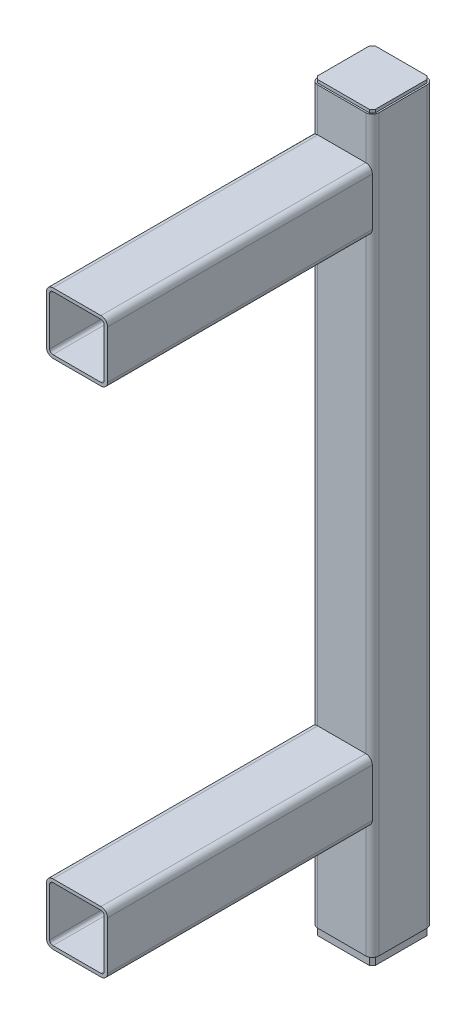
ISO-10303-21;
HEADER;
FILE_DESCRIPTION(('STEP AP214'),'2;1');
FILE_NAME('part.step','',(''),(''),'','','');
FILE_SCHEMA(('AUTOMOTIVE_DESIGN { 1 0 10303 214 1 1 1 1 }'));
ENDSEC;
DATA;
#1=APPLICATION_CONTEXT('core data for automotive mechanical design processes');
#2=APPLICATION_PROTOCOL_DEFINITION('international standard','automotive_design',2000,#1);
#3=PRODUCT_CONTEXT('',#1,'mechanical');
#4=PRODUCT('Part','Part','',(#3));
#5=PRODUCT_RELATED_PRODUCT_CATEGORY('part','',(#4));
#6=PRODUCT_DEFINITION_FORMATION('','',#4);
#7=PRODUCT_DEFINITION_CONTEXT('part definition',#1,'design');
#8=PRODUCT_DEFINITION('design','',#6,#7);
#9=PRODUCT_DEFINITION_SHAPE('','',#8);
#10=(LENGTH_UNIT() NAMED_UNIT(*) SI_UNIT(.MILLI.,.METRE.));
#11=(NAMED_UNIT(*) PLANE_ANGLE_UNIT() SI_UNIT($,.RADIAN.));
#12=(NAMED_UNIT(*) SI_UNIT($,.STERADIAN.) SOLID_ANGLE_UNIT());
#13=UNCERTAINTY_MEASURE_WITH_UNIT(LENGTH_MEASURE(1.E-05),#10,'distance_accuracy_value','');
#14=(GEOMETRIC_REPRESENTATION_CONTEXT(3) GLOBAL_UNCERTAINTY_ASSIGNED_CONTEXT((#13)) GLOBAL_UNIT_ASSIGNED_CONTEXT((#10,
#11,#12)) REPRESENTATION_CONTEXT('',''));
#15=CARTESIAN_POINT('',(0.,0.,0.));
#16=DIRECTION('',(0.,0.,1.));
#17=DIRECTION('',(1.,0.,0.));
#18=AXIS2_PLACEMENT_3D('',#15,#16,#17);
#19=CARTESIAN_POINT('',(25.4,725.,28.4));
#20=DIRECTION('',(0.707106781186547,0.,0.707106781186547));
#21=DIRECTION('',(0.707106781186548,0.,-0.707106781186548));
#22=AXIS2_PLACEMENT_3D('',#19,#20,#21);
#23=PLANE('',#22);
#24=DIRECTION('',(0.707106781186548,0.,-0.707106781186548));
#25=VECTOR('',#24,1.);
#26=CARTESIAN_POINT('',(25.4,728.,28.4));
#27=LINE('',#26,#25);
#28=CARTESIAN_POINT('',(25.4,728.,28.4));
#29=VERTEX_POINT('',#28);
#30=CARTESIAN_POINT('',(28.4,728.,25.4));
#31=VERTEX_POINT('',#30);
#32=EDGE_CURVE('E196',#29,#31,#27,.T.);
#33=ORIENTED_EDGE('',*,*,#32,.F.);
#34=DIRECTION('',(0.,1.,0.));
#35=VECTOR('',#34,1.);
#36=CARTESIAN_POINT('',(25.4,725.,28.4));
#37=LINE('',#36,#35);
#38=CARTESIAN_POINT('',(25.4,725.,28.4));
#39=VERTEX_POINT('',#38);
#40=EDGE_CURVE('E13',#39,#29,#37,.T.);
#41=ORIENTED_EDGE('',*,*,#40,.F.);
#42=DIRECTION('',(0.707106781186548,0.,-0.707106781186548));
#43=VECTOR('',#42,1.);
#44=CARTESIAN_POINT('',(25.4,725.,28.4));
#45=LINE('',#44,#43);
#46=CARTESIAN_POINT('',(28.4,725.,25.4));
#47=VERTEX_POINT('',#46);
#48=EDGE_CURVE('E216',#39,#47,#45,.T.);
#49=ORIENTED_EDGE('',*,*,#48,.T.);
#50=DIRECTION('',(0.,1.,0.));
#51=VECTOR('',#50,1.);
#52=CARTESIAN_POINT('',(28.4,725.,25.4));
#53=LINE('',#52,#51);
#54=EDGE_CURVE('E102',#47,#31,#53,.T.);
#55=ORIENTED_EDGE('',*,*,#54,.T.);
#56=EDGE_LOOP('',(#33,#41,#49,#55));
#57=FACE_BOUND('',#56,.T.);
#58=ADVANCED_FACE('F99',(#57),#23,.T.);
#59=CARTESIAN_POINT('',(-25.4,725.,28.4));
#60=DIRECTION('',(0.,0.,1.));
#61=DIRECTION('',(1.,0.,0.));
#62=AXIS2_PLACEMENT_3D('',#59,#60,#61);
#63=PLANE('',#62);
#64=DIRECTION('',(1.,0.,0.));
#65=VECTOR('',#64,1.);
#66=CARTESIAN_POINT('',(-25.4,728.,28.4));
#67=LINE('',#66,#65);
#68=CARTESIAN_POINT('',(-25.4,728.,28.4));
#69=VERTEX_POINT('',#68);
#70=EDGE_CURVE('E214',#69,#29,#67,.T.);
#71=ORIENTED_EDGE('',*,*,#70,.F.);
#72=DIRECTION('',(0.,1.,0.));
#73=VECTOR('',#72,1.);
#74=CARTESIAN_POINT('',(-25.4,725.,28.4));
#75=LINE('',#74,#73);
#76=CARTESIAN_POINT('',(-25.4,725.,28.4));
#77=VERTEX_POINT('',#76);
#78=EDGE_CURVE('E108',#77,#69,#75,.T.);
#79=ORIENTED_EDGE('',*,*,#78,.F.);
#80=DIRECTION('',(1.,0.,0.));
#81=VECTOR('',#80,1.);
#82=CARTESIAN_POINT('',(-25.4,725.,28.4));
#83=LINE('',#82,#81);
#84=EDGE_CURVE('E186',#77,#39,#83,.T.);
#85=ORIENTED_EDGE('',*,*,#84,.T.);
#86=ORIENTED_EDGE('',*,*,#40,.T.);
#87=EDGE_LOOP('',(#71,#79,#85,#86));
#88=FACE_BOUND('',#87,.T.);
#89=ADVANCED_FACE('F228',(#88),#63,.T.);
#90=CARTESIAN_POINT('',(-28.4,725.,25.4));
#91=DIRECTION('',(-0.707106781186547,0.,0.707106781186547));
#92=DIRECTION('',(0.707106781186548,0.,0.707106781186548));
#93=AXIS2_PLACEMENT_3D('',#90,#91,#92);
#94=PLANE('',#93);
#95=DIRECTION('',(0.707106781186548,0.,0.707106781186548));
#96=VECTOR('',#95,1.);
#97=CARTESIAN_POINT('',(-28.4,728.,25.4));
#98=LINE('',#97,#96);
#99=CARTESIAN_POINT('',(-28.4,728.,25.4));
#100=VERTEX_POINT('',#99);
#101=EDGE_CURVE('E173',#100,#69,#98,.T.);
#102=ORIENTED_EDGE('',*,*,#101,.F.);
#103=DIRECTION('',(0.,1.,0.));
#104=VECTOR('',#103,1.);
#105=CARTESIAN_POINT('',(-28.4,725.,25.4));
#106=LINE('',#105,#104);
#107=CARTESIAN_POINT('',(-28.4,725.,25.4));
#108=VERTEX_POINT('',#107);
#109=EDGE_CURVE('E168',#108,#100,#106,.T.);
#110=ORIENTED_EDGE('',*,*,#109,.F.);
#111=DIRECTION('',(0.707106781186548,0.,0.707106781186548));
#112=VECTOR('',#111,1.);
#113=CARTESIAN_POINT('',(-28.4,725.,25.4));
#114=LINE('',#113,#112);
#115=EDGE_CURVE('E171',#108,#77,#114,.T.);
#116=ORIENTED_EDGE('',*,*,#115,.T.);
#117=ORIENTED_EDGE('',*,*,#78,.T.);
#118=EDGE_LOOP('',(#102,#110,#116,#117));
#119=FACE_BOUND('',#118,.T.);
#120=ADVANCED_FACE('F170',(#119),#94,.T.);
#121=CARTESIAN_POINT('',(-28.4,725.,-25.4));
#122=DIRECTION('',(-1.,0.,0.));
#123=DIRECTION('',(0.,0.,1.));
#124=AXIS2_PLACEMENT_3D('',#121,#122,#123);
#125=PLANE('',#124);
#126=DIRECTION('',(0.,0.,1.));
#127=VECTOR('',#126,1.);
#128=CARTESIAN_POINT('',(-28.4,728.,-25.4));
#129=LINE('',#128,#127);
#130=CARTESIAN_POINT('',(-28.4,728.,-25.4));
#131=VERTEX_POINT('',#130);
#132=EDGE_CURVE('E211',#131,#100,#129,.T.);
#133=ORIENTED_EDGE('',*,*,#132,.F.);
#134=DIRECTION('',(0.,1.,0.));
#135=VECTOR('',#134,1.);
#136=CARTESIAN_POINT('',(-28.4,725.,-25.4));
#137=LINE('',#136,#135);
#138=CARTESIAN_POINT('',(-28.4,725.,-25.4));
#139=VERTEX_POINT('',#138);
#140=EDGE_CURVE('E178',#139,#131,#137,.T.);
#141=ORIENTED_EDGE('',*,*,#140,.F.);
#142=DIRECTION('',(0.,0.,1.));
#143=VECTOR('',#142,1.);
#144=CARTESIAN_POINT('',(-28.4,725.,-25.4));
#145=LINE('',#144,#143);
#146=EDGE_CURVE('E184',#139,#108,#145,.T.);
#147=ORIENTED_EDGE('',*,*,#146,.T.);
#148=ORIENTED_EDGE('',*,*,#109,.T.);
#149=EDGE_LOOP('',(#133,#141,#147,#148));
#150=FACE_BOUND('',#149,.T.);
#151=ADVANCED_FACE('F188',(#150),#125,.T.);
#152=CARTESIAN_POINT('',(-25.4,725.,-28.4));
#153=DIRECTION('',(-0.707106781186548,0.,-0.707106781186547));
#154=DIRECTION('',(-0.707106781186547,0.,0.707106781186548));
#155=AXIS2_PLACEMENT_3D('',#152,#153,#154);
#156=PLANE('',#155);
#157=DIRECTION('',(-0.707106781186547,0.,0.707106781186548));
#158=VECTOR('',#157,1.);
#159=CARTESIAN_POINT('',(-25.4,728.,-28.4));
#160=LINE('',#159,#158);
#161=CARTESIAN_POINT('',(-25.4,728.,-28.4));
#162=VERTEX_POINT('',#161);
#163=EDGE_CURVE('E208',#162,#131,#160,.T.);
#164=ORIENTED_EDGE('',*,*,#163,.F.);
#165=DIRECTION('',(0.,1.,0.));
#166=VECTOR('',#165,1.);
#167=CARTESIAN_POINT('',(-25.4,725.,-28.4));
#168=LINE('',#167,#166);
#169=CARTESIAN_POINT('',(-25.4,725.,-28.4));
#170=VERTEX_POINT('',#169);
#171=EDGE_CURVE('E220',#170,#162,#168,.T.);
#172=ORIENTED_EDGE('',*,*,#171,.F.);
#173=DIRECTION('',(-0.707106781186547,0.,0.707106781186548));
#174=VECTOR('',#173,1.);
#175=CARTESIAN_POINT('',(-25.4,725.,-28.4));
#176=LINE('',#175,#174);
#177=EDGE_CURVE('E189',#170,#139,#176,.T.);
#178=ORIENTED_EDGE('',*,*,#177,.T.);
#179=ORIENTED_EDGE('',*,*,#140,.T.);
#180=EDGE_LOOP('',(#164,#172,#178,#179));
#181=FACE_BOUND('',#180,.T.);
#182=ADVANCED_FACE('F241',(#181),#156,.T.);
#183=CARTESIAN_POINT('',(25.4,725.,-28.4));
#184=DIRECTION('',(0.,0.,-1.));
#185=DIRECTION('',(-1.,0.,0.));
#186=AXIS2_PLACEMENT_3D('',#183,#184,#185);
#187=PLANE('',#186);
#188=DIRECTION('',(-1.,0.,0.));
#189=VECTOR('',#188,1.);
#190=CARTESIAN_POINT('',(25.4,728.,-28.4));
#191=LINE('',#190,#189);
#192=CARTESIAN_POINT('',(25.4,728.,-28.4));
#193=VERTEX_POINT('',#192);
#194=EDGE_CURVE('E205',#193,#162,#191,.T.);
#195=ORIENTED_EDGE('',*,*,#194,.F.);
#196=DIRECTION('',(0.,1.,0.));
#197=VECTOR('',#196,1.);
#198=CARTESIAN_POINT('',(25.4,725.,-28.4));
#199=LINE('',#198,#197);
#200=CARTESIAN_POINT('',(25.4,725.,-28.4));
#201=VERTEX_POINT('',#200);
#202=EDGE_CURVE('E222',#201,#193,#199,.T.);
#203=ORIENTED_EDGE('',*,*,#202,.F.);
#204=DIRECTION('',(-1.,0.,0.));
#205=VECTOR('',#204,1.);
#206=CARTESIAN_POINT('',(25.4,725.,-28.4));
#207=LINE('',#206,#205);
#208=EDGE_CURVE('E191',#201,#170,#207,.T.);
#209=ORIENTED_EDGE('',*,*,#208,.T.);
#210=ORIENTED_EDGE('',*,*,#171,.T.);
#211=EDGE_LOOP('',(#195,#203,#209,#210));
#212=FACE_BOUND('',#211,.T.);
#213=ADVANCED_FACE('F244',(#212),#187,.T.);
#214=CARTESIAN_POINT('',(28.4,725.,-25.4));
#215=DIRECTION('',(0.707106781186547,0.,-0.707106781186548));
#216=DIRECTION('',(-0.707106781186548,0.,-0.707106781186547));
#217=AXIS2_PLACEMENT_3D('',#214,#215,#216);
#218=PLANE('',#217);
#219=DIRECTION('',(-0.707106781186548,0.,-0.707106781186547));
#220=VECTOR('',#219,1.);
#221=CARTESIAN_POINT('',(28.4,728.,-25.4));
#222=LINE('',#221,#220);
#223=CARTESIAN_POINT('',(28.4,728.,-25.4));
#224=VERTEX_POINT('',#223);
#225=EDGE_CURVE('E202',#224,#193,#222,.T.);
#226=ORIENTED_EDGE('',*,*,#225,.F.);
#227=DIRECTION('',(0.,1.,0.));
#228=VECTOR('',#227,1.);
#229=CARTESIAN_POINT('',(28.4,725.,-25.4));
#230=LINE('',#229,#228);
#231=CARTESIAN_POINT('',(28.4,725.,-25.4));
#232=VERTEX_POINT('',#231);
#233=EDGE_CURVE('E223',#232,#224,#230,.T.);
#234=ORIENTED_EDGE('',*,*,#233,.F.);
#235=DIRECTION('',(-0.707106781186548,0.,-0.707106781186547));
#236=VECTOR('',#235,1.);
#237=CARTESIAN_POINT('',(28.4,725.,-25.4));
#238=LINE('',#237,#236);
#239=EDGE_CURVE('E319',#232,#201,#238,.T.);
#240=ORIENTED_EDGE('',*,*,#239,.T.);
#241=ORIENTED_EDGE('',*,*,#202,.T.);
#242=EDGE_LOOP('',(#226,#234,#240,#241));
#243=FACE_BOUND('',#242,.T.);
#244=ADVANCED_FACE('F248',(#243),#218,.T.);
#245=CARTESIAN_POINT('',(28.4,725.,25.4));
#246=DIRECTION('',(1.,0.,0.));
#247=DIRECTION('',(0.,0.,-1.));
#248=AXIS2_PLACEMENT_3D('',#245,#246,#247);
#249=PLANE('',#248);
#250=DIRECTION('',(0.,0.,-1.));
#251=VECTOR('',#250,1.);
#252=CARTESIAN_POINT('',(28.4,728.,25.4));
#253=LINE('',#252,#251);
#254=EDGE_CURVE('E199',#31,#224,#253,.T.);
#255=ORIENTED_EDGE('',*,*,#254,.F.);
#256=ORIENTED_EDGE('',*,*,#54,.F.);
#257=DIRECTION('',(0.,0.,-1.));
#258=VECTOR('',#257,1.);
#259=CARTESIAN_POINT('',(28.4,725.,25.4));
#260=LINE('',#259,#258);
#261=EDGE_CURVE('E320',#47,#232,#260,.T.);
#262=ORIENTED_EDGE('',*,*,#261,.T.);
#263=ORIENTED_EDGE('',*,*,#233,.T.);
#264=EDGE_LOOP('',(#255,#256,#262,#263));
#265=FACE_BOUND('',#264,.T.);
#266=ADVANCED_FACE('F225',(#265),#249,.T.);
#267=CARTESIAN_POINT('',(53.8000000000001,725.,0.));
#268=DIRECTION('',(0.,1.,0.));
#269=DIRECTION('',(0.,0.,1.));
#270=AXIS2_PLACEMENT_3D('',#267,#268,#269);
#271=PLANE('',#270);
#272=ORIENTED_EDGE('',*,*,#48,.F.);
#273=ORIENTED_EDGE('',*,*,#84,.F.);
#274=ORIENTED_EDGE('',*,*,#115,.F.);
#275=ORIENTED_EDGE('',*,*,#146,.F.);
#276=ORIENTED_EDGE('',*,*,#177,.F.);
#277=ORIENTED_EDGE('',*,*,#208,.F.);
#278=ORIENTED_EDGE('',*,*,#239,.F.);
#279=ORIENTED_EDGE('',*,*,#261,.F.);
#280=EDGE_LOOP('',(#272,#273,#274,#275,#276,#277,#278,#279));
#281=FACE_BOUND('',#280,.T.);
#282=ADVANCED_FACE('F182',(#281),#271,.F.);
#283=CARTESIAN_POINT('',(53.8000000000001,728.,0.));
#284=DIRECTION('',(0.,1.,0.));
#285=DIRECTION('',(0.,0.,1.));
#286=AXIS2_PLACEMENT_3D('',#283,#284,#285);
#287=PLANE('',#286);
#288=ORIENTED_EDGE('',*,*,#32,.T.);
#289=ORIENTED_EDGE('',*,*,#254,.T.);
#290=ORIENTED_EDGE('',*,*,#225,.T.);
#291=ORIENTED_EDGE('',*,*,#194,.T.);
#292=ORIENTED_EDGE('',*,*,#163,.T.);
#293=ORIENTED_EDGE('',*,*,#132,.T.);
#294=ORIENTED_EDGE('',*,*,#101,.T.);
#295=ORIENTED_EDGE('',*,*,#70,.T.);
#296=EDGE_LOOP('',(#288,#289,#290,#291,#292,#293,#294,#295));
#297=FACE_BOUND('',#296,.T.);
#298=ADVANCED_FACE('F227',(#297),#287,.T.);
#299=CLOSED_SHELL('',(#58,#89,#120,#151,#182,#213,#244,#266,#282,#298));
#300=MANIFOLD_SOLID_BREP('B2',#299);
#301=CARTESIAN_POINT('',(28.4,8.,25.4));
#302=DIRECTION('',(0.707106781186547,0.,0.707106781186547));
#303=DIRECTION('',(0.707106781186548,0.,-0.707106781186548));
#304=AXIS2_PLACEMENT_3D('',#301,#302,#303);
#305=PLANE('',#304);
#306=DIRECTION('',(-0.707106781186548,0.,0.707106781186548));
#307=VECTOR('',#306,1.);
#308=CARTESIAN_POINT('',(28.4,0.,25.4));
#309=LINE('',#308,#307);
#310=CARTESIAN_POINT('',(28.4,0.,25.4));
#311=VERTEX_POINT('',#310);
#312=CARTESIAN_POINT('',(25.4,0.,28.4));
#313=VERTEX_POINT('',#312);
#314=EDGE_CURVE('E433',#311,#313,#309,.T.);
#315=ORIENTED_EDGE('',*,*,#314,.F.);
#316=DIRECTION('',(0.,-1.,0.));
#317=VECTOR('',#316,1.);
#318=CARTESIAN_POINT('',(28.4,8.,25.4));
#319=LINE('',#318,#317);
#320=CARTESIAN_POINT('',(28.4,8.,25.4));
#321=VERTEX_POINT('',#320);
#322=EDGE_CURVE('E97',#321,#311,#319,.T.);
#323=ORIENTED_EDGE('',*,*,#322,.F.);
#324=DIRECTION('',(-0.707106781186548,0.,0.707106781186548));
#325=VECTOR('',#324,1.);
#326=CARTESIAN_POINT('',(28.4,8.,25.4));
#327=LINE('',#326,#325);
#328=CARTESIAN_POINT('',(25.4,8.,28.4));
#329=VERTEX_POINT('',#328);
#330=EDGE_CURVE('E454',#321,#329,#327,.T.);
#331=ORIENTED_EDGE('',*,*,#330,.T.);
#332=DIRECTION('',(0.,-1.,0.));
#333=VECTOR('',#332,1.);
#334=CARTESIAN_POINT('',(25.4,8.,28.4));
#335=LINE('',#334,#333);
#336=EDGE_CURVE('E339',#329,#313,#335,.T.);
#337=ORIENTED_EDGE('',*,*,#336,.T.);
#338=EDGE_LOOP('',(#315,#323,#331,#337));
#339=FACE_BOUND('',#338,.T.);
#340=ADVANCED_FACE('F336',(#339),#305,.T.);
#341=CARTESIAN_POINT('',(28.4,8.,-25.4));
#342=DIRECTION('',(1.,0.,0.));
#343=DIRECTION('',(0.,0.,-1.));
#344=AXIS2_PLACEMENT_3D('',#341,#342,#343);
#345=PLANE('',#344);
#346=DIRECTION('',(0.,0.,1.));
#347=VECTOR('',#346,1.);
#348=CARTESIAN_POINT('',(28.4,0.,-25.4));
#349=LINE('',#348,#347);
#350=CARTESIAN_POINT('',(28.4,0.,-25.4));
#351=VERTEX_POINT('',#350);
#352=EDGE_CURVE('E452',#351,#311,#349,.T.);
#353=ORIENTED_EDGE('',*,*,#352,.F.);
#354=DIRECTION('',(0.,-1.,0.));
#355=VECTOR('',#354,1.);
#356=CARTESIAN_POINT('',(28.4,8.,-25.4));
#357=LINE('',#356,#355);
#358=CARTESIAN_POINT('',(28.4,8.,-25.4));
#359=VERTEX_POINT('',#358);
#360=EDGE_CURVE('E345',#359,#351,#357,.T.);
#361=ORIENTED_EDGE('',*,*,#360,.F.);
#362=DIRECTION('',(0.,0.,1.));
#363=VECTOR('',#362,1.);
#364=CARTESIAN_POINT('',(28.4,8.,-25.4));
#365=LINE('',#364,#363);
#366=EDGE_CURVE('E423',#359,#321,#365,.T.);
#367=ORIENTED_EDGE('',*,*,#366,.T.);
#368=ORIENTED_EDGE('',*,*,#322,.T.);
#369=EDGE_LOOP('',(#353,#361,#367,#368));
#370=FACE_BOUND('',#369,.T.);
#371=ADVANCED_FACE('F466',(#370),#345,.T.);
#372=CARTESIAN_POINT('',(25.4,8.,-28.4));
#373=DIRECTION('',(0.707106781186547,0.,-0.707106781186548));
#374=DIRECTION('',(-0.707106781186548,0.,-0.707106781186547));
#375=AXIS2_PLACEMENT_3D('',#372,#373,#374);
#376=PLANE('',#375);
#377=DIRECTION('',(0.707106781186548,0.,0.707106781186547));
#378=VECTOR('',#377,1.);
#379=CARTESIAN_POINT('',(25.4,0.,-28.4));
#380=LINE('',#379,#378);
#381=CARTESIAN_POINT('',(25.4,0.,-28.4));
#382=VERTEX_POINT('',#381);
#383=EDGE_CURVE('E410',#382,#351,#380,.T.);
#384=ORIENTED_EDGE('',*,*,#383,.F.);
#385=DIRECTION('',(0.,-1.,0.));
#386=VECTOR('',#385,1.);
#387=CARTESIAN_POINT('',(25.4,8.,-28.4));
#388=LINE('',#387,#386);
#389=CARTESIAN_POINT('',(25.4,8.,-28.4));
#390=VERTEX_POINT('',#389);
#391=EDGE_CURVE('E405',#390,#382,#388,.T.);
#392=ORIENTED_EDGE('',*,*,#391,.F.);
#393=DIRECTION('',(0.707106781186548,0.,0.707106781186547));
#394=VECTOR('',#393,1.);
#395=CARTESIAN_POINT('',(25.4,8.,-28.4));
#396=LINE('',#395,#394);
#397=EDGE_CURVE('E408',#390,#359,#396,.T.);
#398=ORIENTED_EDGE('',*,*,#397,.T.);
#399=ORIENTED_EDGE('',*,*,#360,.T.);
#400=EDGE_LOOP('',(#384,#392,#398,#399));
#401=FACE_BOUND('',#400,.T.);
#402=ADVANCED_FACE('F407',(#401),#376,.T.);
#403=CARTESIAN_POINT('',(-25.4,8.,-28.4));
#404=DIRECTION('',(0.,0.,-1.));
#405=DIRECTION('',(-1.,0.,0.));
#406=AXIS2_PLACEMENT_3D('',#403,#404,#405);
#407=PLANE('',#406);
#408=DIRECTION('',(1.,0.,0.));
#409=VECTOR('',#408,1.);
#410=CARTESIAN_POINT('',(-25.4,0.,-28.4));
#411=LINE('',#410,#409);
#412=CARTESIAN_POINT('',(-25.4,0.,-28.4));
#413=VERTEX_POINT('',#412);
#414=EDGE_CURVE('E449',#413,#382,#411,.T.);
#415=ORIENTED_EDGE('',*,*,#414,.F.);
#416=DIRECTION('',(0.,-1.,0.));
#417=VECTOR('',#416,1.);
#418=CARTESIAN_POINT('',(-25.4,8.,-28.4));
#419=LINE('',#418,#417);
#420=CARTESIAN_POINT('',(-25.4,8.,-28.4));
#421=VERTEX_POINT('',#420);
#422=EDGE_CURVE('E415',#421,#413,#419,.T.);
#423=ORIENTED_EDGE('',*,*,#422,.F.);
#424=DIRECTION('',(1.,0.,0.));
#425=VECTOR('',#424,1.);
#426=CARTESIAN_POINT('',(-25.4,8.,-28.4));
#427=LINE('',#426,#425);
#428=EDGE_CURVE('E421',#421,#390,#427,.T.);
#429=ORIENTED_EDGE('',*,*,#428,.T.);
#430=ORIENTED_EDGE('',*,*,#391,.T.);
#431=EDGE_LOOP('',(#415,#423,#429,#430));
#432=FACE_BOUND('',#431,.T.);
#433=ADVANCED_FACE('F425',(#432),#407,.T.);
#434=CARTESIAN_POINT('',(-28.4,8.,-25.4));
#435=DIRECTION('',(-0.707106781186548,0.,-0.707106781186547));
#436=DIRECTION('',(-0.707106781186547,0.,0.707106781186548));
#437=AXIS2_PLACEMENT_3D('',#434,#435,#436);
#438=PLANE('',#437);
#439=DIRECTION('',(0.707106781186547,0.,-0.707106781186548));
#440=VECTOR('',#439,1.);
#441=CARTESIAN_POINT('',(-28.4,0.,-25.4));
#442=LINE('',#441,#440);
#443=CARTESIAN_POINT('',(-28.4,0.,-25.4));
#444=VERTEX_POINT('',#443);
#445=EDGE_CURVE('E446',#444,#413,#442,.T.);
#446=ORIENTED_EDGE('',*,*,#445,.F.);
#447=DIRECTION('',(0.,-1.,0.));
#448=VECTOR('',#447,1.);
#449=CARTESIAN_POINT('',(-28.4,8.,-25.4));
#450=LINE('',#449,#448);
#451=CARTESIAN_POINT('',(-28.4,8.,-25.4));
#452=VERTEX_POINT('',#451);
#453=EDGE_CURVE('E458',#452,#444,#450,.T.);
#454=ORIENTED_EDGE('',*,*,#453,.F.);
#455=DIRECTION('',(0.707106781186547,0.,-0.707106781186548));
#456=VECTOR('',#455,1.);
#457=CARTESIAN_POINT('',(-28.4,8.,-25.4));
#458=LINE('',#457,#456);
#459=EDGE_CURVE('E426',#452,#421,#458,.T.);
#460=ORIENTED_EDGE('',*,*,#459,.T.);
#461=ORIENTED_EDGE('',*,*,#422,.T.);
#462=EDGE_LOOP('',(#446,#454,#460,#461));
#463=FACE_BOUND('',#462,.T.);
#464=ADVANCED_FACE('F479',(#463),#438,.T.);
#465=CARTESIAN_POINT('',(-28.4,8.,25.4));
#466=DIRECTION('',(-1.,0.,0.));
#467=DIRECTION('',(0.,0.,1.));
#468=AXIS2_PLACEMENT_3D('',#465,#466,#467);
#469=PLANE('',#468);
#470=DIRECTION('',(0.,0.,-1.));
#471=VECTOR('',#470,1.);
#472=CARTESIAN_POINT('',(-28.4,0.,25.4));
#473=LINE('',#472,#471);
#474=CARTESIAN_POINT('',(-28.4,0.,25.4));
#475=VERTEX_POINT('',#474);
#476=EDGE_CURVE('E443',#475,#444,#473,.T.);
#477=ORIENTED_EDGE('',*,*,#476,.F.);
#478=DIRECTION('',(0.,-1.,0.));
#479=VECTOR('',#478,1.);
#480=CARTESIAN_POINT('',(-28.4,8.,25.4));
#481=LINE('',#480,#479);
#482=CARTESIAN_POINT('',(-28.4,8.,25.4));
#483=VERTEX_POINT('',#482);
#484=EDGE_CURVE('E460',#483,#475,#481,.T.);
#485=ORIENTED_EDGE('',*,*,#484,.F.);
#486=DIRECTION('',(0.,0.,-1.));
#487=VECTOR('',#486,1.);
#488=CARTESIAN_POINT('',(-28.4,8.,25.4));
#489=LINE('',#488,#487);
#490=EDGE_CURVE('E428',#483,#452,#489,.T.);
#491=ORIENTED_EDGE('',*,*,#490,.T.);
#492=ORIENTED_EDGE('',*,*,#453,.T.);
#493=EDGE_LOOP('',(#477,#485,#491,#492));
#494=FACE_BOUND('',#493,.T.);
#495=ADVANCED_FACE('F482',(#494),#469,.T.);
#496=CARTESIAN_POINT('',(-25.4,8.,28.4));
#497=DIRECTION('',(-0.707106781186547,0.,0.707106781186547));
#498=DIRECTION('',(0.707106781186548,0.,0.707106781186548));
#499=AXIS2_PLACEMENT_3D('',#496,#497,#498);
#500=PLANE('',#499);
#501=DIRECTION('',(-0.707106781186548,0.,-0.707106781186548));
#502=VECTOR('',#501,1.);
#503=CARTESIAN_POINT('',(-25.4,0.,28.4));
#504=LINE('',#503,#502);
#505=CARTESIAN_POINT('',(-25.4,0.,28.4));
#506=VERTEX_POINT('',#505);
#507=EDGE_CURVE('E440',#506,#475,#504,.T.);
#508=ORIENTED_EDGE('',*,*,#507,.F.);
#509=DIRECTION('',(0.,-1.,0.));
#510=VECTOR('',#509,1.);
#511=CARTESIAN_POINT('',(-25.4,8.,28.4));
#512=LINE('',#511,#510);
#513=CARTESIAN_POINT('',(-25.4,8.,28.4));
#514=VERTEX_POINT('',#513);
#515=EDGE_CURVE('E461',#514,#506,#512,.T.);
#516=ORIENTED_EDGE('',*,*,#515,.F.);
#517=DIRECTION('',(-0.707106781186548,0.,-0.707106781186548));
#518=VECTOR('',#517,1.);
#519=CARTESIAN_POINT('',(-25.4,8.,28.4));
#520=LINE('',#519,#518);
#521=EDGE_CURVE('E517',#514,#483,#520,.T.);
#522=ORIENTED_EDGE('',*,*,#521,.T.);
#523=ORIENTED_EDGE('',*,*,#484,.T.);
#524=EDGE_LOOP('',(#508,#516,#522,#523));
#525=FACE_BOUND('',#524,.T.);
#526=ADVANCED_FACE('F486',(#525),#500,.T.);
#527=CARTESIAN_POINT('',(25.4,8.,28.4));
#528=DIRECTION('',(0.,0.,1.));
#529=DIRECTION('',(1.,0.,0.));
#530=AXIS2_PLACEMENT_3D('',#527,#528,#529);
#531=PLANE('',#530);
#532=DIRECTION('',(-1.,0.,0.));
#533=VECTOR('',#532,1.);
#534=CARTESIAN_POINT('',(25.4,0.,28.4));
#535=LINE('',#534,#533);
#536=EDGE_CURVE('E436',#313,#506,#535,.T.);
#537=ORIENTED_EDGE('',*,*,#536,.F.);
#538=ORIENTED_EDGE('',*,*,#336,.F.);
#539=DIRECTION('',(-1.,0.,0.));
#540=VECTOR('',#539,1.);
#541=CARTESIAN_POINT('',(25.4,8.,28.4));
#542=LINE('',#541,#540);
#543=EDGE_CURVE('E515',#329,#514,#542,.T.);
#544=ORIENTED_EDGE('',*,*,#543,.T.);
#545=ORIENTED_EDGE('',*,*,#515,.T.);
#546=EDGE_LOOP('',(#537,#538,#544,#545));
#547=FACE_BOUND('',#546,.T.);
#548=ADVANCED_FACE('F463',(#547),#531,.T.);
#549=CARTESIAN_POINT('',(0.,8.,53.8));
#550=DIRECTION('',(0.,-1.,0.));
#551=DIRECTION('',(0.,0.,-1.));
#552=AXIS2_PLACEMENT_3D('',#549,#550,#551);
#553=PLANE('',#552);
#554=CARTESIAN_POINT('',(0.,8.,0.));
#555=DIRECTION('',(0.,-1.,0.));
#556=DIRECTION('',(0.,0.,-1.));
#557=AXIS2_PLACEMENT_3D('',#554,#555,#556);
#558=CIRCLE('',#557,5.09999999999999);
#559=CARTESIAN_POINT('',(0.,8.,-5.09999999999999));
#560=VERTEX_POINT('',#559);
#561=EDGE_CURVE('E437',#560,#560,#558,.T.);
#562=ORIENTED_EDGE('',*,*,#561,.T.);
#563=EDGE_LOOP('',(#562));
#564=FACE_BOUND('',#563,.T.);
#565=ORIENTED_EDGE('',*,*,#330,.F.);
#566=ORIENTED_EDGE('',*,*,#366,.F.);
#567=ORIENTED_EDGE('',*,*,#397,.F.);
#568=ORIENTED_EDGE('',*,*,#428,.F.);
#569=ORIENTED_EDGE('',*,*,#459,.F.);
#570=ORIENTED_EDGE('',*,*,#490,.F.);
#571=ORIENTED_EDGE('',*,*,#521,.F.);
#572=ORIENTED_EDGE('',*,*,#543,.F.);
#573=EDGE_LOOP('',(#565,#566,#567,#568,#569,#570,#571,#572));
#574=FACE_BOUND('',#573,.T.);
#575=ADVANCED_FACE('F419',(#564,#574),#553,.F.);
#576=CARTESIAN_POINT('',(0.,0.,53.8));
#577=DIRECTION('',(0.,-1.,0.));
#578=DIRECTION('',(0.,0.,-1.));
#579=AXIS2_PLACEMENT_3D('',#576,#577,#578);
#580=PLANE('',#579);
#581=CARTESIAN_POINT('',(0.,0.,0.));
#582=DIRECTION('',(0.,-1.,0.));
#583=DIRECTION('',(0.,0.,-1.));
#584=AXIS2_PLACEMENT_3D('',#581,#582,#583);
#585=CIRCLE('',#584,5.1);
#586=CARTESIAN_POINT('',(0.,0.,-5.1));
#587=VERTEX_POINT('',#586);
#588=EDGE_CURVE('E509',#587,#587,#585,.T.);
#589=ORIENTED_EDGE('',*,*,#588,.F.);
#590=EDGE_LOOP('',(#589));
#591=FACE_BOUND('',#590,.T.);
#592=ORIENTED_EDGE('',*,*,#314,.T.);
#593=ORIENTED_EDGE('',*,*,#536,.T.);
#594=ORIENTED_EDGE('',*,*,#507,.T.);
#595=ORIENTED_EDGE('',*,*,#476,.T.);
#596=ORIENTED_EDGE('',*,*,#445,.T.);
#597=ORIENTED_EDGE('',*,*,#414,.T.);
#598=ORIENTED_EDGE('',*,*,#383,.T.);
#599=ORIENTED_EDGE('',*,*,#352,.T.);
#600=EDGE_LOOP('',(#592,#593,#594,#595,#596,#597,#598,#599));
#601=FACE_BOUND('',#600,.T.);
#602=ADVANCED_FACE('F465',(#591,#601),#580,.T.);
#603=CARTESIAN_POINT('',(0.,0.,0.));
#604=DIRECTION('',(0.,-1.,0.));
#605=DIRECTION('',(0.,0.,-1.));
#606=AXIS2_PLACEMENT_3D('',#603,#604,#605);
#607=CYLINDRICAL_SURFACE('',#606,5.09999999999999);
#608=ORIENTED_EDGE('',*,*,#588,.T.);
#609=EDGE_LOOP('',(#608));
#610=FACE_BOUND('',#609,.T.);
#611=ORIENTED_EDGE('',*,*,#561,.F.);
#612=EDGE_LOOP('',(#611));
#613=FACE_BOUND('',#612,.T.);
#614=ADVANCED_FACE('F498',(#610,#613),#607,.F.);
#615=CLOSED_SHELL('',(#340,#371,#402,#433,#464,#495,#526,#548,#575,#602,#614));
#616=MANIFOLD_SOLID_BREP('B7',#615);
#617=CARTESIAN_POINT('',(23.6,126.4,290.));
#618=DIRECTION('',(0.,0.,-1.));
#619=DIRECTION('',(0.,1.,0.));
#620=AXIS2_PLACEMENT_3D('',#617,#618,#619);
#621=CYLINDRICAL_SURFACE('',#620,6.40000000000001);
#622=CARTESIAN_POINT('',(23.6,126.4,30.));
#623=DIRECTION('',(0.,0.,-1.));
#624=DIRECTION('',(-1.,0.,0.));
#625=AXIS2_PLACEMENT_3D('',#622,#623,#624);
#626=CIRCLE('',#625,6.40000000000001);
#627=CARTESIAN_POINT('',(30.,126.4,30.));
#628=VERTEX_POINT('',#627);
#629=CARTESIAN_POINT('',(23.6,120.,30.));
#630=VERTEX_POINT('',#629);
#631=EDGE_CURVE('E772',#628,#630,#626,.T.);
#632=ORIENTED_EDGE('',*,*,#631,.F.);
#633=DIRECTION('',(0.,0.,-1.));
#634=VECTOR('',#633,1.);
#635=CARTESIAN_POINT('',(30.,126.4,290.));
#636=LINE('',#635,#634);
#637=CARTESIAN_POINT('',(30.,126.4,290.));
#638=VERTEX_POINT('',#637);
#639=EDGE_CURVE('E694',#638,#628,#636,.T.);
#640=ORIENTED_EDGE('',*,*,#639,.F.);
#641=CARTESIAN_POINT('',(23.6,126.4,290.));
#642=DIRECTION('',(0.,0.,1.));
#643=DIRECTION('',(0.,-1.,0.));
#644=AXIS2_PLACEMENT_3D('',#641,#642,#643);
#645=CIRCLE('',#644,6.40000000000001);
#646=CARTESIAN_POINT('',(23.6,120.,290.));
#647=VERTEX_POINT('',#646);
#648=EDGE_CURVE('E689',#647,#638,#645,.T.);
#649=ORIENTED_EDGE('',*,*,#648,.F.);
#650=DIRECTION('',(0.,0.,-1.));
#651=VECTOR('',#650,1.);
#652=CARTESIAN_POINT('',(23.6,120.,290.));
#653=LINE('',#652,#651);
#654=EDGE_CURVE('E691',#647,#630,#653,.T.);
#655=ORIENTED_EDGE('',*,*,#654,.T.);
#656=EDGE_LOOP('',(#632,#640,#649,#655));
#657=FACE_BOUND('',#656,.T.);
#658=ADVANCED_FACE('F598',(#657),#621,.T.);
#659=CARTESIAN_POINT('',(30.,126.4,290.));
#660=DIRECTION('',(-1.,0.,0.));
#661=DIRECTION('',(0.,-1.,0.));
#662=AXIS2_PLACEMENT_3D('',#659,#660,#661);
#663=PLANE('',#662);
#664=DIRECTION('',(0.,-1.,0.));
#665=VECTOR('',#664,1.);
#666=CARTESIAN_POINT('',(30.,728.,30.));
#667=LINE('',#666,#665);
#668=CARTESIAN_POINT('',(30.,173.6,30.));
#669=VERTEX_POINT('',#668);
#670=EDGE_CURVE('E757',#669,#628,#667,.T.);
#671=ORIENTED_EDGE('',*,*,#670,.F.);
#672=DIRECTION('',(0.,0.,-1.));
#673=VECTOR('',#672,1.);
#674=CARTESIAN_POINT('',(30.,173.6,290.));
#675=LINE('',#674,#673);
#676=CARTESIAN_POINT('',(30.,173.6,290.));
#677=VERTEX_POINT('',#676);
#678=EDGE_CURVE('E780',#677,#669,#675,.T.);
#679=ORIENTED_EDGE('',*,*,#678,.F.);
#680=DIRECTION('',(0.,1.,0.));
#681=VECTOR('',#680,1.);
#682=CARTESIAN_POINT('',(30.,126.4,290.));
#683=LINE('',#682,#681);
#684=EDGE_CURVE('E864',#638,#677,#683,.T.);
#685=ORIENTED_EDGE('',*,*,#684,.F.);
#686=ORIENTED_EDGE('',*,*,#639,.T.);
#687=EDGE_LOOP('',(#671,#679,#685,#686));
#688=FACE_BOUND('',#687,.T.);
#689=ADVANCED_FACE('F851',(#688),#663,.F.);
#690=CARTESIAN_POINT('',(23.6,173.6,290.));
#691=DIRECTION('',(0.,0.,-1.));
#692=DIRECTION('',(0.,1.,0.));
#693=AXIS2_PLACEMENT_3D('',#690,#691,#692);
#694=CYLINDRICAL_SURFACE('',#693,6.40000000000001);
#695=CARTESIAN_POINT('',(23.6,173.6,30.));
#696=DIRECTION('',(0.,0.,-1.));
#697=DIRECTION('',(-1.,0.,0.));
#698=AXIS2_PLACEMENT_3D('',#695,#696,#697);
#699=CIRCLE('',#698,6.40000000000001);
#700=CARTESIAN_POINT('',(23.6,180.,30.));
#701=VERTEX_POINT('',#700);
#702=EDGE_CURVE('E756',#701,#669,#699,.T.);
#703=ORIENTED_EDGE('',*,*,#702,.F.);
#704=DIRECTION('',(0.,0.,-1.));
#705=VECTOR('',#704,1.);
#706=CARTESIAN_POINT('',(23.6,180.,290.));
#707=LINE('',#706,#705);
#708=CARTESIAN_POINT('',(23.6,180.,290.));
#709=VERTEX_POINT('',#708);
#710=EDGE_CURVE('E782',#709,#701,#707,.T.);
#711=ORIENTED_EDGE('',*,*,#710,.F.);
#712=CARTESIAN_POINT('',(23.6,173.6,290.));
#713=DIRECTION('',(0.,0.,1.));
#714=DIRECTION('',(0.,-1.,0.));
#715=AXIS2_PLACEMENT_3D('',#712,#713,#714);
#716=CIRCLE('',#715,6.40000000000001);
#717=EDGE_CURVE('E796',#677,#709,#716,.T.);
#718=ORIENTED_EDGE('',*,*,#717,.F.);
#719=ORIENTED_EDGE('',*,*,#678,.T.);
#720=EDGE_LOOP('',(#703,#711,#718,#719));
#721=FACE_BOUND('',#720,.T.);
#722=ADVANCED_FACE('F793',(#721),#694,.T.);
#723=CARTESIAN_POINT('',(-23.6,180.,290.));
#724=DIRECTION('',(0.,-1.,0.));
#725=DIRECTION('',(1.,0.,0.));
#726=AXIS2_PLACEMENT_3D('',#723,#724,#725);
#727=PLANE('',#726);
#728=DIRECTION('',(1.,0.,0.));
#729=VECTOR('',#728,1.);
#730=CARTESIAN_POINT('',(-23.6,180.,30.));
#731=LINE('',#730,#729);
#732=CARTESIAN_POINT('',(-23.6,180.,30.));
#733=VERTEX_POINT('',#732);
#734=EDGE_CURVE('E334',#733,#701,#731,.T.);
#735=ORIENTED_EDGE('',*,*,#734,.F.);
#736=DIRECTION('',(0.,0.,-1.));
#737=VECTOR('',#736,1.);
#738=CARTESIAN_POINT('',(-23.6,180.,290.));
#739=LINE('',#738,#737);
#740=CARTESIAN_POINT('',(-23.6,180.,290.));
#741=VERTEX_POINT('',#740);
#742=EDGE_CURVE('E666',#741,#733,#739,.T.);
#743=ORIENTED_EDGE('',*,*,#742,.F.);
#744=DIRECTION('',(-1.,0.,0.));
#745=VECTOR('',#744,1.);
#746=CARTESIAN_POINT('',(-23.6,180.,290.));
#747=LINE('',#746,#745);
#748=EDGE_CURVE('E790',#709,#741,#747,.T.);
#749=ORIENTED_EDGE('',*,*,#748,.F.);
#750=ORIENTED_EDGE('',*,*,#710,.T.);
#751=EDGE_LOOP('',(#735,#743,#749,#750));
#752=FACE_BOUND('',#751,.T.);
#753=ADVANCED_FACE('F787',(#752),#727,.F.);
#754=CARTESIAN_POINT('',(-23.6,173.6,290.));
#755=DIRECTION('',(0.,0.,-1.));
#756=DIRECTION('',(0.,1.,0.));
#757=AXIS2_PLACEMENT_3D('',#754,#755,#756);
#758=CYLINDRICAL_SURFACE('',#757,6.39999999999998);
#759=CARTESIAN_POINT('',(-23.6,173.6,30.));
#760=DIRECTION('',(0.,0.,-1.));
#761=DIRECTION('',(-1.,0.,0.));
#762=AXIS2_PLACEMENT_3D('',#759,#760,#761);
#763=CIRCLE('',#762,6.39999999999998);
#764=CARTESIAN_POINT('',(-30.,173.6,30.));
#765=VERTEX_POINT('',#764);
#766=EDGE_CURVE('E607',#765,#733,#763,.T.);
#767=ORIENTED_EDGE('',*,*,#766,.F.);
#768=DIRECTION('',(0.,0.,-1.));
#769=VECTOR('',#768,1.);
#770=CARTESIAN_POINT('',(-30.,173.6,290.));
#771=LINE('',#770,#769);
#772=CARTESIAN_POINT('',(-30.,173.6,290.));
#773=VERTEX_POINT('',#772);
#774=EDGE_CURVE('E665',#773,#765,#771,.T.);
#775=ORIENTED_EDGE('',*,*,#774,.F.);
#776=CARTESIAN_POINT('',(-23.6,173.6,290.));
#777=DIRECTION('',(0.,0.,1.));
#778=DIRECTION('',(0.,-1.,0.));
#779=AXIS2_PLACEMENT_3D('',#776,#777,#778);
#780=CIRCLE('',#779,6.39999999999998);
#781=EDGE_CURVE('E873',#741,#773,#780,.T.);
#782=ORIENTED_EDGE('',*,*,#781,.F.);
#783=ORIENTED_EDGE('',*,*,#742,.T.);
#784=EDGE_LOOP('',(#767,#775,#782,#783));
#785=FACE_BOUND('',#784,.T.);
#786=ADVANCED_FACE('F671',(#785),#758,.T.);
#787=CARTESIAN_POINT('',(-30.,173.6,290.));
#788=DIRECTION('',(1.,0.,0.));
#789=DIRECTION('',(0.,1.,0.));
#790=AXIS2_PLACEMENT_3D('',#787,#788,#789);
#791=PLANE('',#790);
#792=DIRECTION('',(0.,-1.,0.));
#793=VECTOR('',#792,1.);
#794=CARTESIAN_POINT('',(-30.,728.,30.));
#795=LINE('',#794,#793);
#796=CARTESIAN_POINT('',(-30.,126.4,30.));
#797=VERTEX_POINT('',#796);
#798=EDGE_CURVE('E658',#765,#797,#795,.T.);
#799=ORIENTED_EDGE('',*,*,#798,.T.);
#800=DIRECTION('',(0.,0.,-1.));
#801=VECTOR('',#800,1.);
#802=CARTESIAN_POINT('',(-30.,126.4,290.));
#803=LINE('',#802,#801);
#804=CARTESIAN_POINT('',(-30.,126.4,290.));
#805=VERTEX_POINT('',#804);
#806=EDGE_CURVE('E680',#805,#797,#803,.T.);
#807=ORIENTED_EDGE('',*,*,#806,.F.);
#808=DIRECTION('',(0.,-1.,0.));
#809=VECTOR('',#808,1.);
#810=CARTESIAN_POINT('',(-30.,173.6,290.));
#811=LINE('',#810,#809);
#812=EDGE_CURVE('E679',#773,#805,#811,.T.);
#813=ORIENTED_EDGE('',*,*,#812,.F.);
#814=ORIENTED_EDGE('',*,*,#774,.T.);
#815=EDGE_LOOP('',(#799,#807,#813,#814));
#816=FACE_BOUND('',#815,.T.);
#817=ADVANCED_FACE('F677',(#816),#791,.F.);
#818=CARTESIAN_POINT('',(-23.6,126.4,290.));
#819=DIRECTION('',(0.,0.,-1.));
#820=DIRECTION('',(0.,1.,0.));
#821=AXIS2_PLACEMENT_3D('',#818,#819,#820);
#822=CYLINDRICAL_SURFACE('',#821,6.40000000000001);
#823=CARTESIAN_POINT('',(-23.6,126.4,30.));
#824=DIRECTION('',(0.,0.,-1.));
#825=DIRECTION('',(-1.,0.,0.));
#826=AXIS2_PLACEMENT_3D('',#823,#824,#825);
#827=CIRCLE('',#826,6.40000000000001);
#828=CARTESIAN_POINT('',(-23.6,120.,30.));
#829=VERTEX_POINT('',#828);
#830=EDGE_CURVE('E656',#829,#797,#827,.T.);
#831=ORIENTED_EDGE('',*,*,#830,.F.);
#832=DIRECTION('',(0.,0.,-1.));
#833=VECTOR('',#832,1.);
#834=CARTESIAN_POINT('',(-23.6,120.,290.));
#835=LINE('',#834,#833);
#836=CARTESIAN_POINT('',(-23.6,120.,290.));
#837=VERTEX_POINT('',#836);
#838=EDGE_CURVE('E686',#837,#829,#835,.T.);
#839=ORIENTED_EDGE('',*,*,#838,.F.);
#840=CARTESIAN_POINT('',(-23.6,126.4,290.));
#841=DIRECTION('',(0.,0.,1.));
#842=DIRECTION('',(0.,-1.,0.));
#843=AXIS2_PLACEMENT_3D('',#840,#841,#842);
#844=CIRCLE('',#843,6.40000000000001);
#845=EDGE_CURVE('E877',#805,#837,#844,.T.);
#846=ORIENTED_EDGE('',*,*,#845,.F.);
#847=ORIENTED_EDGE('',*,*,#806,.T.);
#848=EDGE_LOOP('',(#831,#839,#846,#847));
#849=FACE_BOUND('',#848,.T.);
#850=ADVANCED_FACE('F848',(#849),#822,.T.);
#851=CARTESIAN_POINT('',(23.6,173.6,290.));
#852=DIRECTION('',(0.,0.,-1.));
#853=DIRECTION('',(0.,1.,0.));
#854=AXIS2_PLACEMENT_3D('',#851,#852,#853);
#855=CYLINDRICAL_SURFACE('',#854,3.2);
#856=DIRECTION('',(0.,0.,-1.));
#857=VECTOR('',#856,1.);
#858=CARTESIAN_POINT('',(23.6,176.8,290.));
#859=LINE('',#858,#857);
#860=CARTESIAN_POINT('',(23.6,176.8,290.));
#861=VERTEX_POINT('',#860);
#862=CARTESIAN_POINT('',(23.6,176.8,30.));
#863=VERTEX_POINT('',#862);
#864=EDGE_CURVE('E601',#861,#863,#859,.T.);
#865=ORIENTED_EDGE('',*,*,#864,.T.);
#866=CARTESIAN_POINT('',(23.6,173.6,30.));
#867=DIRECTION('',(0.,0.,-1.));
#868=DIRECTION('',(-1.,0.,0.));
#869=AXIS2_PLACEMENT_3D('',#866,#867,#868);
#870=CIRCLE('',#869,3.2);
#871=CARTESIAN_POINT('',(26.8,173.6,30.));
#872=VERTEX_POINT('',#871);
#873=EDGE_CURVE('E755',#863,#872,#870,.T.);
#874=ORIENTED_EDGE('',*,*,#873,.T.);
#875=DIRECTION('',(0.,0.,-1.));
#876=VECTOR('',#875,1.);
#877=CARTESIAN_POINT('',(26.8,173.6,290.));
#878=LINE('',#877,#876);
#879=CARTESIAN_POINT('',(26.8,173.6,290.));
#880=VERTEX_POINT('',#879);
#881=EDGE_CURVE('E695',#880,#872,#878,.T.);
#882=ORIENTED_EDGE('',*,*,#881,.F.);
#883=CARTESIAN_POINT('',(23.6,173.6,290.));
#884=DIRECTION('',(0.,0.,1.));
#885=DIRECTION('',(0.,-1.,0.));
#886=AXIS2_PLACEMENT_3D('',#883,#884,#885);
#887=CIRCLE('',#886,3.2);
#888=EDGE_CURVE('E699',#880,#861,#887,.T.);
#889=ORIENTED_EDGE('',*,*,#888,.T.);
#890=EDGE_LOOP('',(#865,#874,#882,#889));
#891=FACE_BOUND('',#890,.T.);
#892=ADVANCED_FACE('F831',(#891),#855,.F.);
#893=CARTESIAN_POINT('',(26.8,126.4,290.));
#894=DIRECTION('',(-1.,0.,0.));
#895=DIRECTION('',(0.,-1.,0.));
#896=AXIS2_PLACEMENT_3D('',#893,#894,#895);
#897=PLANE('',#896);
#898=ORIENTED_EDGE('',*,*,#881,.T.);
#899=DIRECTION('',(0.,-1.,0.));
#900=VECTOR('',#899,1.);
#901=CARTESIAN_POINT('',(26.8,126.4,30.));
#902=LINE('',#901,#900);
#903=CARTESIAN_POINT('',(26.8,126.4,30.));
#904=VERTEX_POINT('',#903);
#905=EDGE_CURVE('E698',#872,#904,#902,.T.);
#906=ORIENTED_EDGE('',*,*,#905,.T.);
#907=DIRECTION('',(0.,0.,-1.));
#908=VECTOR('',#907,1.);
#909=CARTESIAN_POINT('',(26.8,126.4,290.));
#910=LINE('',#909,#908);
#911=CARTESIAN_POINT('',(26.8,126.4,290.));
#912=VERTEX_POINT('',#911);
#913=EDGE_CURVE('E700',#912,#904,#910,.T.);
#914=ORIENTED_EDGE('',*,*,#913,.F.);
#915=DIRECTION('',(0.,1.,0.));
#916=VECTOR('',#915,1.);
#917=CARTESIAN_POINT('',(26.8,126.4,290.));
#918=LINE('',#917,#916);
#919=EDGE_CURVE('E704',#912,#880,#918,.T.);
#920=ORIENTED_EDGE('',*,*,#919,.T.);
#921=EDGE_LOOP('',(#898,#906,#914,#920));
#922=FACE_BOUND('',#921,.T.);
#923=ADVANCED_FACE('F837',(#922),#897,.T.);
#924=CARTESIAN_POINT('',(23.6,126.4,290.));
#925=DIRECTION('',(0.,0.,-1.));
#926=DIRECTION('',(0.,1.,0.));
#927=AXIS2_PLACEMENT_3D('',#924,#925,#926);
#928=CYLINDRICAL_SURFACE('',#927,3.2);
#929=ORIENTED_EDGE('',*,*,#913,.T.);
#930=CARTESIAN_POINT('',(23.6,126.4,30.));
#931=DIRECTION('',(0.,0.,-1.));
#932=DIRECTION('',(-1.,0.,0.));
#933=AXIS2_PLACEMENT_3D('',#930,#931,#932);
#934=CIRCLE('',#933,3.2);
#935=CARTESIAN_POINT('',(23.6,123.2,30.));
#936=VERTEX_POINT('',#935);
#937=EDGE_CURVE('E703',#904,#936,#934,.T.);
#938=ORIENTED_EDGE('',*,*,#937,.T.);
#939=DIRECTION('',(0.,0.,-1.));
#940=VECTOR('',#939,1.);
#941=CARTESIAN_POINT('',(23.6,123.2,290.));
#942=LINE('',#941,#940);
#943=CARTESIAN_POINT('',(23.6,123.2,290.));
#944=VERTEX_POINT('',#943);
#945=EDGE_CURVE('E705',#944,#936,#942,.T.);
#946=ORIENTED_EDGE('',*,*,#945,.F.);
#947=CARTESIAN_POINT('',(23.6,126.4,290.));
#948=DIRECTION('',(0.,0.,1.));
#949=DIRECTION('',(0.,-1.,0.));
#950=AXIS2_PLACEMENT_3D('',#947,#948,#949);
#951=CIRCLE('',#950,3.2);
#952=EDGE_CURVE('E709',#944,#912,#951,.T.);
#953=ORIENTED_EDGE('',*,*,#952,.T.);
#954=EDGE_LOOP('',(#929,#938,#946,#953));
#955=FACE_BOUND('',#954,.T.);
#956=ADVANCED_FACE('F839',(#955),#928,.F.);
#957=CARTESIAN_POINT('',(23.6,123.2,290.));
#958=DIRECTION('',(0.,1.,0.));
#959=DIRECTION('',(0.,0.,1.));
#960=AXIS2_PLACEMENT_3D('',#957,#958,#959);
#961=PLANE('',#960);
#962=ORIENTED_EDGE('',*,*,#945,.T.);
#963=DIRECTION('',(-1.,0.,0.));
#964=VECTOR('',#963,1.);
#965=CARTESIAN_POINT('',(23.6,123.2,30.));
#966=LINE('',#965,#964);
#967=CARTESIAN_POINT('',(-23.6,123.2,30.));
#968=VERTEX_POINT('',#967);
#969=EDGE_CURVE('E708',#936,#968,#966,.T.);
#970=ORIENTED_EDGE('',*,*,#969,.T.);
#971=DIRECTION('',(0.,0.,-1.));
#972=VECTOR('',#971,1.);
#973=CARTESIAN_POINT('',(-23.6,123.2,290.));
#974=LINE('',#973,#972);
#975=CARTESIAN_POINT('',(-23.6,123.2,290.));
#976=VERTEX_POINT('',#975);
#977=EDGE_CURVE('E710',#976,#968,#974,.T.);
#978=ORIENTED_EDGE('',*,*,#977,.F.);
#979=DIRECTION('',(1.,0.,0.));
#980=VECTOR('',#979,1.);
#981=CARTESIAN_POINT('',(23.6,123.2,290.));
#982=LINE('',#981,#980);
#983=EDGE_CURVE('E714',#976,#944,#982,.T.);
#984=ORIENTED_EDGE('',*,*,#983,.T.);
#985=EDGE_LOOP('',(#962,#970,#978,#984));
#986=FACE_BOUND('',#985,.T.);
#987=ADVANCED_FACE('F845',(#986),#961,.T.);
#988=CARTESIAN_POINT('',(-23.6,126.4,290.));
#989=DIRECTION('',(0.,0.,-1.));
#990=DIRECTION('',(0.,1.,0.));
#991=AXIS2_PLACEMENT_3D('',#988,#989,#990);
#992=CYLINDRICAL_SURFACE('',#991,3.2);
#993=ORIENTED_EDGE('',*,*,#977,.T.);
#994=CARTESIAN_POINT('',(-23.6,126.4,30.));
#995=DIRECTION('',(0.,0.,-1.));
#996=DIRECTION('',(-1.,0.,0.));
#997=AXIS2_PLACEMENT_3D('',#994,#995,#996);
#998=CIRCLE('',#997,3.2);
#999=CARTESIAN_POINT('',(-26.8,126.4,30.));
#1000=VERTEX_POINT('',#999);
#1001=EDGE_CURVE('E713',#968,#1000,#998,.T.);
#1002=ORIENTED_EDGE('',*,*,#1001,.T.);
#1003=DIRECTION('',(0.,0.,-1.));
#1004=VECTOR('',#1003,1.);
#1005=CARTESIAN_POINT('',(-26.8,126.4,290.));
#1006=LINE('',#1005,#1004);
#1007=CARTESIAN_POINT('',(-26.8,126.4,290.));
#1008=VERTEX_POINT('',#1007);
#1009=EDGE_CURVE('E715',#1008,#1000,#1006,.T.);
#1010=ORIENTED_EDGE('',*,*,#1009,.F.);
#1011=CARTESIAN_POINT('',(-23.6,126.4,290.));
#1012=DIRECTION('',(0.,0.,1.));
#1013=DIRECTION('',(0.,-1.,0.));
#1014=AXIS2_PLACEMENT_3D('',#1011,#1012,#1013);
#1015=CIRCLE('',#1014,3.2);
#1016=EDGE_CURVE('E719',#1008,#976,#1015,.T.);
#1017=ORIENTED_EDGE('',*,*,#1016,.T.);
#1018=EDGE_LOOP('',(#993,#1002,#1010,#1017));
#1019=FACE_BOUND('',#1018,.T.);
#1020=ADVANCED_FACE('F909',(#1019),#992,.F.);
#1021=CARTESIAN_POINT('',(-26.8,173.6,290.));
#1022=DIRECTION('',(1.,0.,0.));
#1023=DIRECTION('',(0.,1.,0.));
#1024=AXIS2_PLACEMENT_3D('',#1021,#1022,#1023);
#1025=PLANE('',#1024);
#1026=ORIENTED_EDGE('',*,*,#1009,.T.);
#1027=DIRECTION('',(0.,1.,0.));
#1028=VECTOR('',#1027,1.);
#1029=CARTESIAN_POINT('',(-26.8,173.6,30.));
#1030=LINE('',#1029,#1028);
#1031=CARTESIAN_POINT('',(-26.8,173.6,30.));
#1032=VERTEX_POINT('',#1031);
#1033=EDGE_CURVE('E718',#1000,#1032,#1030,.T.);
#1034=ORIENTED_EDGE('',*,*,#1033,.T.);
#1035=DIRECTION('',(0.,0.,-1.));
#1036=VECTOR('',#1035,1.);
#1037=CARTESIAN_POINT('',(-26.8,173.6,290.));
#1038=LINE('',#1037,#1036);
#1039=CARTESIAN_POINT('',(-26.8,173.6,290.));
#1040=VERTEX_POINT('',#1039);
#1041=EDGE_CURVE('E720',#1040,#1032,#1038,.T.);
#1042=ORIENTED_EDGE('',*,*,#1041,.F.);
#1043=DIRECTION('',(0.,-1.,0.));
#1044=VECTOR('',#1043,1.);
#1045=CARTESIAN_POINT('',(-26.8,173.6,290.));
#1046=LINE('',#1045,#1044);
#1047=EDGE_CURVE('E723',#1040,#1008,#1046,.T.);
#1048=ORIENTED_EDGE('',*,*,#1047,.T.);
#1049=EDGE_LOOP('',(#1026,#1034,#1042,#1048));
#1050=FACE_BOUND('',#1049,.T.);
#1051=ADVANCED_FACE('F902',(#1050),#1025,.T.);
#1052=CARTESIAN_POINT('',(-23.6,173.6,290.));
#1053=DIRECTION('',(0.,0.,-1.));
#1054=DIRECTION('',(0.,1.,0.));
#1055=AXIS2_PLACEMENT_3D('',#1052,#1053,#1054);
#1056=CYLINDRICAL_SURFACE('',#1055,3.19999999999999);
#1057=ORIENTED_EDGE('',*,*,#1041,.T.);
#1058=CARTESIAN_POINT('',(-23.6,173.6,30.));
#1059=DIRECTION('',(0.,0.,-1.));
#1060=DIRECTION('',(-1.,0.,0.));
#1061=AXIS2_PLACEMENT_3D('',#1058,#1059,#1060);
#1062=CIRCLE('',#1061,3.19999999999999);
#1063=CARTESIAN_POINT('',(-23.6,176.8,30.));
#1064=VERTEX_POINT('',#1063);
#1065=EDGE_CURVE('E722',#1032,#1064,#1062,.T.);
#1066=ORIENTED_EDGE('',*,*,#1065,.T.);
#1067=DIRECTION('',(0.,0.,-1.));
#1068=VECTOR('',#1067,1.);
#1069=CARTESIAN_POINT('',(-23.6,176.8,290.));
#1070=LINE('',#1069,#1068);
#1071=CARTESIAN_POINT('',(-23.6,176.8,290.));
#1072=VERTEX_POINT('',#1071);
#1073=EDGE_CURVE('E724',#1072,#1064,#1070,.T.);
#1074=ORIENTED_EDGE('',*,*,#1073,.F.);
#1075=CARTESIAN_POINT('',(-23.6,173.6,290.));
#1076=DIRECTION('',(0.,0.,1.));
#1077=DIRECTION('',(0.,-1.,0.));
#1078=AXIS2_PLACEMENT_3D('',#1075,#1076,#1077);
#1079=CIRCLE('',#1078,3.19999999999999);
#1080=EDGE_CURVE('E727',#1072,#1040,#1079,.T.);
#1081=ORIENTED_EDGE('',*,*,#1080,.T.);
#1082=EDGE_LOOP('',(#1057,#1066,#1074,#1081));
#1083=FACE_BOUND('',#1082,.T.);
#1084=ADVANCED_FACE('F895',(#1083),#1056,.F.);
#1085=CARTESIAN_POINT('',(-23.6,176.8,290.));
#1086=DIRECTION('',(0.,-1.,0.));
#1087=DIRECTION('',(0.,0.,-1.));
#1088=AXIS2_PLACEMENT_3D('',#1085,#1086,#1087);
#1089=PLANE('',#1088);
#1090=ORIENTED_EDGE('',*,*,#1073,.T.);
#1091=DIRECTION('',(1.,0.,0.));
#1092=VECTOR('',#1091,1.);
#1093=CARTESIAN_POINT('',(-23.6,176.8,30.));
#1094=LINE('',#1093,#1092);
#1095=EDGE_CURVE('E726',#1064,#863,#1094,.T.);
#1096=ORIENTED_EDGE('',*,*,#1095,.T.);
#1097=ORIENTED_EDGE('',*,*,#864,.F.);
#1098=DIRECTION('',(-1.,0.,0.));
#1099=VECTOR('',#1098,1.);
#1100=CARTESIAN_POINT('',(-23.6,176.8,290.));
#1101=LINE('',#1100,#1099);
#1102=EDGE_CURVE('E690',#861,#1072,#1101,.T.);
#1103=ORIENTED_EDGE('',*,*,#1102,.T.);
#1104=EDGE_LOOP('',(#1090,#1096,#1097,#1103));
#1105=FACE_BOUND('',#1104,.T.);
#1106=ADVANCED_FACE('F893',(#1105),#1089,.T.);
#1107=CARTESIAN_POINT('',(23.6,120.,290.));
#1108=DIRECTION('',(0.,1.,0.));
#1109=DIRECTION('',(0.,0.,1.));
#1110=AXIS2_PLACEMENT_3D('',#1107,#1108,#1109);
#1111=PLANE('',#1110);
#1112=DIRECTION('',(-1.,0.,0.));
#1113=VECTOR('',#1112,1.);
#1114=CARTESIAN_POINT('',(23.6,120.,30.));
#1115=LINE('',#1114,#1113);
#1116=EDGE_CURVE('E775',#630,#829,#1115,.T.);
#1117=ORIENTED_EDGE('',*,*,#1116,.F.);
#1118=ORIENTED_EDGE('',*,*,#654,.F.);
#1119=DIRECTION('',(1.,0.,0.));
#1120=VECTOR('',#1119,1.);
#1121=CARTESIAN_POINT('',(23.6,120.,290.));
#1122=LINE('',#1121,#1120);
#1123=EDGE_CURVE('E758',#837,#647,#1122,.T.);
#1124=ORIENTED_EDGE('',*,*,#1123,.F.);
#1125=ORIENTED_EDGE('',*,*,#838,.T.);
#1126=EDGE_LOOP('',(#1117,#1118,#1124,#1125));
#1127=FACE_BOUND('',#1126,.T.);
#1128=ADVANCED_FACE('F885',(#1127),#1111,.F.);
#1129=CARTESIAN_POINT('',(23.6,126.4,290.));
#1130=DIRECTION('',(0.,0.,1.));
#1131=DIRECTION('',(0.,-1.,0.));
#1132=AXIS2_PLACEMENT_3D('',#1129,#1130,#1131);
#1133=PLANE('',#1132);
#1134=ORIENTED_EDGE('',*,*,#888,.F.);
#1135=ORIENTED_EDGE('',*,*,#919,.F.);
#1136=ORIENTED_EDGE('',*,*,#952,.F.);
#1137=ORIENTED_EDGE('',*,*,#983,.F.);
#1138=ORIENTED_EDGE('',*,*,#1016,.F.);
#1139=ORIENTED_EDGE('',*,*,#1047,.F.);
#1140=ORIENTED_EDGE('',*,*,#1080,.F.);
#1141=ORIENTED_EDGE('',*,*,#1102,.F.);
#1142=EDGE_LOOP('',(#1134,#1135,#1136,#1137,#1138,#1139,#1140,#1141));
#1143=FACE_BOUND('',#1142,.T.);
#1144=ORIENTED_EDGE('',*,*,#648,.T.);
#1145=ORIENTED_EDGE('',*,*,#684,.T.);
#1146=ORIENTED_EDGE('',*,*,#717,.T.);
#1147=ORIENTED_EDGE('',*,*,#748,.T.);
#1148=ORIENTED_EDGE('',*,*,#781,.T.);
#1149=ORIENTED_EDGE('',*,*,#812,.T.);
#1150=ORIENTED_EDGE('',*,*,#845,.T.);
#1151=ORIENTED_EDGE('',*,*,#1123,.T.);
#1152=EDGE_LOOP('',(#1144,#1145,#1146,#1147,#1148,#1149,#1150,#1151));
#1153=FACE_BOUND('',#1152,.T.);
#1154=ADVANCED_FACE('F835',(#1143,#1153),#1133,.T.);
#1155=CARTESIAN_POINT('',(23.6,728.,30.));
#1156=DIRECTION('',(0.,0.,-1.));
#1157=DIRECTION('',(-1.,0.,0.));
#1158=AXIS2_PLACEMENT_3D('',#1155,#1156,#1157);
#1159=PLANE('',#1158);
#1160=ORIENTED_EDGE('',*,*,#1095,.F.);
#1161=ORIENTED_EDGE('',*,*,#1065,.F.);
#1162=ORIENTED_EDGE('',*,*,#1033,.F.);
#1163=ORIENTED_EDGE('',*,*,#1001,.F.);
#1164=ORIENTED_EDGE('',*,*,#969,.F.);
#1165=ORIENTED_EDGE('',*,*,#937,.F.);
#1166=ORIENTED_EDGE('',*,*,#905,.F.);
#1167=ORIENTED_EDGE('',*,*,#873,.F.);
#1168=EDGE_LOOP('',(#1160,#1161,#1162,#1163,#1164,#1165,#1166,#1167));
#1169=FACE_BOUND('',#1168,.T.);
#1170=ORIENTED_EDGE('',*,*,#702,.T.);
#1171=ORIENTED_EDGE('',*,*,#670,.T.);
#1172=ORIENTED_EDGE('',*,*,#631,.T.);
#1173=ORIENTED_EDGE('',*,*,#1116,.T.);
#1174=ORIENTED_EDGE('',*,*,#830,.T.);
#1175=ORIENTED_EDGE('',*,*,#798,.F.);
#1176=ORIENTED_EDGE('',*,*,#766,.T.);
#1177=ORIENTED_EDGE('',*,*,#734,.T.);
#1178=EDGE_LOOP('',(#1170,#1171,#1172,#1173,#1174,#1175,#1176,#1177));
#1179=FACE_BOUND('',#1178,.T.);
#1180=ADVANCED_FACE('F660',(#1169,#1179),#1159,.T.);
#1181=CLOSED_SHELL('',(#658,#689,#722,#753,#786,#817,#850,#892,#923,#956,#987,#1020,#1051,#1084,
#1106,#1128,#1154,#1180));
#1182=MANIFOLD_SOLID_BREP('B91',#1181);
#1183=CARTESIAN_POINT('',(23.6,628.9,290.));
#1184=DIRECTION('',(0.,0.,-1.));
#1185=DIRECTION('',(-1.,0.,0.));
#1186=AXIS2_PLACEMENT_3D('',#1183,#1184,#1185);
#1187=CYLINDRICAL_SURFACE('',#1186,6.40000000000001);
#1188=CARTESIAN_POINT('',(23.6,628.9,30.));
#1189=DIRECTION('',(0.,0.,-1.));
#1190=DIRECTION('',(-1.,0.,0.));
#1191=AXIS2_PLACEMENT_3D('',#1188,#1189,#1190);
#1192=CIRCLE('',#1191,6.40000000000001);
#1193=CARTESIAN_POINT('',(30.,628.9,30.));
#1194=VERTEX_POINT('',#1193);
#1195=CARTESIAN_POINT('',(23.6,622.5,30.));
#1196=VERTEX_POINT('',#1195);
#1197=EDGE_CURVE('E1270',#1194,#1196,#1192,.T.);
#1198=ORIENTED_EDGE('',*,*,#1197,.F.);
#1199=DIRECTION('',(0.,0.,-1.));
#1200=VECTOR('',#1199,1.);
#1201=CARTESIAN_POINT('',(30.,628.9,290.));
#1202=LINE('',#1201,#1200);
#1203=CARTESIAN_POINT('',(30.,628.9,290.));
#1204=VERTEX_POINT('',#1203);
#1205=EDGE_CURVE('E1280',#1204,#1194,#1202,.T.);
#1206=ORIENTED_EDGE('',*,*,#1205,.F.);
#1207=CARTESIAN_POINT('',(23.6,628.9,290.));
#1208=DIRECTION('',(0.,0.,1.));
#1209=DIRECTION('',(0.,-1.,0.));
#1210=AXIS2_PLACEMENT_3D('',#1207,#1208,#1209);
#1211=CIRCLE('',#1210,6.40000000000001);
#1212=CARTESIAN_POINT('',(23.6,622.5,290.));
#1213=VERTEX_POINT('',#1212);
#1214=EDGE_CURVE('E1300',#1213,#1204,#1211,.T.);
#1215=ORIENTED_EDGE('',*,*,#1214,.F.);
#1216=DIRECTION('',(0.,0.,-1.));
#1217=VECTOR('',#1216,1.);
#1218=CARTESIAN_POINT('',(23.6,622.5,290.));
#1219=LINE('',#1218,#1217);
#1220=EDGE_CURVE('E1284',#1213,#1196,#1219,.T.);
#1221=ORIENTED_EDGE('',*,*,#1220,.T.);
#1222=EDGE_LOOP('',(#1198,#1206,#1215,#1221));
#1223=FACE_BOUND('',#1222,.T.);
#1224=ADVANCED_FACE('F1091',(#1223),#1187,.T.);
#1225=CARTESIAN_POINT('',(30.,628.9,290.));
#1226=DIRECTION('',(-1.,0.,0.));
#1227=DIRECTION('',(0.,-1.,0.));
#1228=AXIS2_PLACEMENT_3D('',#1225,#1226,#1227);
#1229=PLANE('',#1228);
#1230=DIRECTION('',(0.,-1.,0.));
#1231=VECTOR('',#1230,1.);
#1232=CARTESIAN_POINT('',(30.,728.,30.));
#1233=LINE('',#1232,#1231);
#1234=CARTESIAN_POINT('',(30.,676.1,30.));
#1235=VERTEX_POINT('',#1234);
#1236=EDGE_CURVE('E1150',#1235,#1194,#1233,.T.);
#1237=ORIENTED_EDGE('',*,*,#1236,.F.);
#1238=DIRECTION('',(0.,0.,-1.));
#1239=VECTOR('',#1238,1.);
#1240=CARTESIAN_POINT('',(30.,676.1,290.));
#1241=LINE('',#1240,#1239);
#1242=CARTESIAN_POINT('',(30.,676.1,290.));
#1243=VERTEX_POINT('',#1242);
#1244=EDGE_CURVE('E1283',#1243,#1235,#1241,.T.);
#1245=ORIENTED_EDGE('',*,*,#1244,.F.);
#1246=DIRECTION('',(0.,1.,0.));
#1247=VECTOR('',#1246,1.);
#1248=CARTESIAN_POINT('',(30.,628.9,290.));
#1249=LINE('',#1248,#1247);
#1250=EDGE_CURVE('E1356',#1204,#1243,#1249,.T.);
#1251=ORIENTED_EDGE('',*,*,#1250,.F.);
#1252=ORIENTED_EDGE('',*,*,#1205,.T.);
#1253=EDGE_LOOP('',(#1237,#1245,#1251,#1252));
#1254=FACE_BOUND('',#1253,.T.);
#1255=ADVANCED_FACE('F1344',(#1254),#1229,.F.);
#1256=CARTESIAN_POINT('',(23.6,676.1,290.));
#1257=DIRECTION('',(0.,0.,-1.));
#1258=DIRECTION('',(-1.,0.,0.));
#1259=AXIS2_PLACEMENT_3D('',#1256,#1257,#1258);
#1260=CYLINDRICAL_SURFACE('',#1259,6.40000000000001);
#1261=CARTESIAN_POINT('',(23.6,676.1,30.));
#1262=DIRECTION('',(0.,0.,-1.));
#1263=DIRECTION('',(-1.,0.,0.));
#1264=AXIS2_PLACEMENT_3D('',#1261,#1262,#1263);
#1265=CIRCLE('',#1264,6.40000000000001);
#1266=CARTESIAN_POINT('',(23.6,682.5,30.));
#1267=VERTEX_POINT('',#1266);
#1268=EDGE_CURVE('E1153',#1267,#1235,#1265,.T.);
#1269=ORIENTED_EDGE('',*,*,#1268,.F.);
#1270=DIRECTION('',(0.,0.,-1.));
#1271=VECTOR('',#1270,1.);
#1272=CARTESIAN_POINT('',(23.6,682.5,290.));
#1273=LINE('',#1272,#1271);
#1274=CARTESIAN_POINT('',(23.6,682.5,290.));
#1275=VERTEX_POINT('',#1274);
#1276=EDGE_CURVE('E1287',#1275,#1267,#1273,.T.);
#1277=ORIENTED_EDGE('',*,*,#1276,.F.);
#1278=CARTESIAN_POINT('',(23.6,676.1,290.));
#1279=DIRECTION('',(0.,0.,1.));
#1280=DIRECTION('',(0.,-1.,0.));
#1281=AXIS2_PLACEMENT_3D('',#1278,#1279,#1280);
#1282=CIRCLE('',#1281,6.40000000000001);
#1283=EDGE_CURVE('E1359',#1243,#1275,#1282,.T.);
#1284=ORIENTED_EDGE('',*,*,#1283,.F.);
#1285=ORIENTED_EDGE('',*,*,#1244,.T.);
#1286=EDGE_LOOP('',(#1269,#1277,#1284,#1285));
#1287=FACE_BOUND('',#1286,.T.);
#1288=ADVANCED_FACE('F1349',(#1287),#1260,.T.);
#1289=CARTESIAN_POINT('',(-23.6,682.5,290.));
#1290=DIRECTION('',(0.,-1.,0.));
#1291=DIRECTION('',(1.,0.,0.));
#1292=AXIS2_PLACEMENT_3D('',#1289,#1290,#1291);
#1293=PLANE('',#1292);
#1294=DIRECTION('',(1.,0.,0.));
#1295=VECTOR('',#1294,1.);
#1296=CARTESIAN_POINT('',(-23.6,682.5,30.));
#1297=LINE('',#1296,#1295);
#1298=CARTESIAN_POINT('',(-23.6,682.5,30.));
#1299=VERTEX_POINT('',#1298);
#1300=EDGE_CURVE('E596',#1299,#1267,#1297,.T.);
#1301=ORIENTED_EDGE('',*,*,#1300,.F.);
#1302=DIRECTION('',(0.,0.,-1.));
#1303=VECTOR('',#1302,1.);
#1304=CARTESIAN_POINT('',(-23.6,682.5,290.));
#1305=LINE('',#1304,#1303);
#1306=CARTESIAN_POINT('',(-23.6,682.5,290.));
#1307=VERTEX_POINT('',#1306);
#1308=EDGE_CURVE('E1278',#1307,#1299,#1305,.T.);
#1309=ORIENTED_EDGE('',*,*,#1308,.F.);
#1310=DIRECTION('',(-1.,0.,0.));
#1311=VECTOR('',#1310,1.);
#1312=CARTESIAN_POINT('',(-23.6,682.5,290.));
#1313=LINE('',#1312,#1311);
#1314=EDGE_CURVE('E1364',#1275,#1307,#1313,.T.);
#1315=ORIENTED_EDGE('',*,*,#1314,.F.);
#1316=ORIENTED_EDGE('',*,*,#1276,.T.);
#1317=EDGE_LOOP('',(#1301,#1309,#1315,#1316));
#1318=FACE_BOUND('',#1317,.T.);
#1319=ADVANCED_FACE('F1398',(#1318),#1293,.F.);
#1320=CARTESIAN_POINT('',(-23.6,676.1,290.));
#1321=DIRECTION('',(0.,0.,-1.));
#1322=DIRECTION('',(-1.,0.,0.));
#1323=AXIS2_PLACEMENT_3D('',#1320,#1321,#1322);
#1324=CYLINDRICAL_SURFACE('',#1323,6.39999999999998);
#1325=CARTESIAN_POINT('',(-23.6,676.1,30.));
#1326=DIRECTION('',(0.,0.,-1.));
#1327=DIRECTION('',(-1.,0.,0.));
#1328=AXIS2_PLACEMENT_3D('',#1325,#1326,#1327);
#1329=CIRCLE('',#1328,6.39999999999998);
#1330=CARTESIAN_POINT('',(-30.,676.1,30.));
#1331=VERTEX_POINT('',#1330);
#1332=EDGE_CURVE('E1100',#1331,#1299,#1329,.T.);
#1333=ORIENTED_EDGE('',*,*,#1332,.F.);
#1334=DIRECTION('',(0.,0.,-1.));
#1335=VECTOR('',#1334,1.);
#1336=CARTESIAN_POINT('',(-30.,676.1,290.));
#1337=LINE('',#1336,#1335);
#1338=CARTESIAN_POINT('',(-30.,676.1,290.));
#1339=VERTEX_POINT('',#1338);
#1340=EDGE_CURVE('E1277',#1339,#1331,#1337,.T.);
#1341=ORIENTED_EDGE('',*,*,#1340,.F.);
#1342=CARTESIAN_POINT('',(-23.6,676.1,290.));
#1343=DIRECTION('',(0.,0.,1.));
#1344=DIRECTION('',(0.,-1.,0.));
#1345=AXIS2_PLACEMENT_3D('',#1342,#1343,#1344);
#1346=CIRCLE('',#1345,6.39999999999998);
#1347=EDGE_CURVE('E1366',#1307,#1339,#1346,.T.);
#1348=ORIENTED_EDGE('',*,*,#1347,.F.);
#1349=ORIENTED_EDGE('',*,*,#1308,.T.);
#1350=EDGE_LOOP('',(#1333,#1341,#1348,#1349));
#1351=FACE_BOUND('',#1350,.T.);
#1352=ADVANCED_FACE('F1394',(#1351),#1324,.T.);
#1353=CARTESIAN_POINT('',(-30.,676.1,290.));
#1354=DIRECTION('',(1.,0.,0.));
#1355=DIRECTION('',(0.,1.,0.));
#1356=AXIS2_PLACEMENT_3D('',#1353,#1354,#1355);
#1357=PLANE('',#1356);
#1358=DIRECTION('',(0.,-1.,0.));
#1359=VECTOR('',#1358,1.);
#1360=CARTESIAN_POINT('',(-30.,728.,30.));
#1361=LINE('',#1360,#1359);
#1362=CARTESIAN_POINT('',(-30.,628.9,30.));
#1363=VERTEX_POINT('',#1362);
#1364=EDGE_CURVE('E1274',#1331,#1363,#1361,.T.);
#1365=ORIENTED_EDGE('',*,*,#1364,.T.);
#1366=DIRECTION('',(0.,0.,-1.));
#1367=VECTOR('',#1366,1.);
#1368=CARTESIAN_POINT('',(-30.,628.9,290.));
#1369=LINE('',#1368,#1367);
#1370=CARTESIAN_POINT('',(-30.,628.9,290.));
#1371=VERTEX_POINT('',#1370);
#1372=EDGE_CURVE('E1294',#1371,#1363,#1369,.T.);
#1373=ORIENTED_EDGE('',*,*,#1372,.F.);
#1374=DIRECTION('',(0.,-1.,0.));
#1375=VECTOR('',#1374,1.);
#1376=CARTESIAN_POINT('',(-30.,676.1,290.));
#1377=LINE('',#1376,#1375);
#1378=EDGE_CURVE('E1368',#1339,#1371,#1377,.T.);
#1379=ORIENTED_EDGE('',*,*,#1378,.F.);
#1380=ORIENTED_EDGE('',*,*,#1340,.T.);
#1381=EDGE_LOOP('',(#1365,#1373,#1379,#1380));
#1382=FACE_BOUND('',#1381,.T.);
#1383=ADVANCED_FACE('F1391',(#1382),#1357,.F.);
#1384=CARTESIAN_POINT('',(-23.6,628.9,290.));
#1385=DIRECTION('',(0.,0.,-1.));
#1386=DIRECTION('',(-1.,0.,0.));
#1387=AXIS2_PLACEMENT_3D('',#1384,#1385,#1386);
#1388=CYLINDRICAL_SURFACE('',#1387,6.40000000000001);
#1389=CARTESIAN_POINT('',(-23.6,628.9,30.));
#1390=DIRECTION('',(0.,0.,-1.));
#1391=DIRECTION('',(-1.,0.,0.));
#1392=AXIS2_PLACEMENT_3D('',#1389,#1390,#1391);
#1393=CIRCLE('',#1392,6.40000000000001);
#1394=CARTESIAN_POINT('',(-23.6,622.5,30.));
#1395=VERTEX_POINT('',#1394);
#1396=EDGE_CURVE('E1243',#1395,#1363,#1393,.T.);
#1397=ORIENTED_EDGE('',*,*,#1396,.F.);
#1398=DIRECTION('',(0.,0.,-1.));
#1399=VECTOR('',#1398,1.);
#1400=CARTESIAN_POINT('',(-23.6,622.5,290.));
#1401=LINE('',#1400,#1399);
#1402=CARTESIAN_POINT('',(-23.6,622.5,290.));
#1403=VERTEX_POINT('',#1402);
#1404=EDGE_CURVE('E1297',#1403,#1395,#1401,.T.);
#1405=ORIENTED_EDGE('',*,*,#1404,.F.);
#1406=CARTESIAN_POINT('',(-23.6,628.9,290.));
#1407=DIRECTION('',(0.,0.,1.));
#1408=DIRECTION('',(0.,-1.,0.));
#1409=AXIS2_PLACEMENT_3D('',#1406,#1407,#1408);
#1410=CIRCLE('',#1409,6.40000000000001);
#1411=EDGE_CURVE('E1370',#1371,#1403,#1410,.T.);
#1412=ORIENTED_EDGE('',*,*,#1411,.F.);
#1413=ORIENTED_EDGE('',*,*,#1372,.T.);
#1414=EDGE_LOOP('',(#1397,#1405,#1412,#1413));
#1415=FACE_BOUND('',#1414,.T.);
#1416=ADVANCED_FACE('F1377',(#1415),#1388,.T.);
#1417=CARTESIAN_POINT('',(23.6,676.1,290.));
#1418=DIRECTION('',(0.,0.,-1.));
#1419=DIRECTION('',(-1.,0.,0.));
#1420=AXIS2_PLACEMENT_3D('',#1417,#1418,#1419);
#1421=CYLINDRICAL_SURFACE('',#1420,3.2);
#1422=DIRECTION('',(0.,0.,-1.));
#1423=VECTOR('',#1422,1.);
#1424=CARTESIAN_POINT('',(23.6,679.3,290.));
#1425=LINE('',#1424,#1423);
#1426=CARTESIAN_POINT('',(23.6,679.3,290.));
#1427=VERTEX_POINT('',#1426);
#1428=CARTESIAN_POINT('',(23.6,679.3,30.));
#1429=VERTEX_POINT('',#1428);
#1430=EDGE_CURVE('E1094',#1427,#1429,#1425,.T.);
#1431=ORIENTED_EDGE('',*,*,#1430,.T.);
#1432=CARTESIAN_POINT('',(23.6,676.1,30.));
#1433=DIRECTION('',(0.,0.,-1.));
#1434=DIRECTION('',(-1.,0.,0.));
#1435=AXIS2_PLACEMENT_3D('',#1432,#1433,#1434);
#1436=CIRCLE('',#1435,3.2);
#1437=CARTESIAN_POINT('',(26.8,676.1,30.));
#1438=VERTEX_POINT('',#1437);
#1439=EDGE_CURVE('E1158',#1429,#1438,#1436,.T.);
#1440=ORIENTED_EDGE('',*,*,#1439,.T.);
#1441=DIRECTION('',(0.,0.,-1.));
#1442=VECTOR('',#1441,1.);
#1443=CARTESIAN_POINT('',(26.8,676.1,290.));
#1444=LINE('',#1443,#1442);
#1445=CARTESIAN_POINT('',(26.8,676.1,290.));
#1446=VERTEX_POINT('',#1445);
#1447=EDGE_CURVE('E1213',#1446,#1438,#1444,.T.);
#1448=ORIENTED_EDGE('',*,*,#1447,.F.);
#1449=CARTESIAN_POINT('',(23.6,676.1,290.));
#1450=DIRECTION('',(0.,0.,1.));
#1451=DIRECTION('',(0.,-1.,0.));
#1452=AXIS2_PLACEMENT_3D('',#1449,#1450,#1451);
#1453=CIRCLE('',#1452,3.2);
#1454=EDGE_CURVE('E1217',#1446,#1427,#1453,.T.);
#1455=ORIENTED_EDGE('',*,*,#1454,.T.);
#1456=EDGE_LOOP('',(#1431,#1440,#1448,#1455));
#1457=FACE_BOUND('',#1456,.T.);
#1458=ADVANCED_FACE('F1216',(#1457),#1421,.F.);
#1459=CARTESIAN_POINT('',(26.8,628.9,290.));
#1460=DIRECTION('',(-1.,0.,0.));
#1461=DIRECTION('',(0.,-1.,0.));
#1462=AXIS2_PLACEMENT_3D('',#1459,#1460,#1461);
#1463=PLANE('',#1462);
#1464=ORIENTED_EDGE('',*,*,#1447,.T.);
#1465=DIRECTION('',(0.,-1.,0.));
#1466=VECTOR('',#1465,1.);
#1467=CARTESIAN_POINT('',(26.8,628.9,30.));
#1468=LINE('',#1467,#1466);
#1469=CARTESIAN_POINT('',(26.8,628.9,30.));
#1470=VERTEX_POINT('',#1469);
#1471=EDGE_CURVE('E1219',#1438,#1470,#1468,.T.);
#1472=ORIENTED_EDGE('',*,*,#1471,.T.);
#1473=DIRECTION('',(0.,0.,-1.));
#1474=VECTOR('',#1473,1.);
#1475=CARTESIAN_POINT('',(26.8,628.9,290.));
#1476=LINE('',#1475,#1474);
#1477=CARTESIAN_POINT('',(26.8,628.9,290.));
#1478=VERTEX_POINT('',#1477);
#1479=EDGE_CURVE('E1207',#1478,#1470,#1476,.T.);
#1480=ORIENTED_EDGE('',*,*,#1479,.F.);
#1481=DIRECTION('',(0.,1.,0.));
#1482=VECTOR('',#1481,1.);
#1483=CARTESIAN_POINT('',(26.8,628.9,290.));
#1484=LINE('',#1483,#1482);
#1485=EDGE_CURVE('E1225',#1478,#1446,#1484,.T.);
#1486=ORIENTED_EDGE('',*,*,#1485,.T.);
#1487=EDGE_LOOP('',(#1464,#1472,#1480,#1486));
#1488=FACE_BOUND('',#1487,.T.);
#1489=ADVANCED_FACE('F1231',(#1488),#1463,.T.);
#1490=CARTESIAN_POINT('',(23.6,628.9,290.));
#1491=DIRECTION('',(0.,0.,-1.));
#1492=DIRECTION('',(-1.,0.,0.));
#1493=AXIS2_PLACEMENT_3D('',#1490,#1491,#1492);
#1494=CYLINDRICAL_SURFACE('',#1493,3.2);
#1495=ORIENTED_EDGE('',*,*,#1479,.T.);
#1496=CARTESIAN_POINT('',(23.6,628.9,30.));
#1497=DIRECTION('',(0.,0.,-1.));
#1498=DIRECTION('',(-1.,0.,0.));
#1499=AXIS2_PLACEMENT_3D('',#1496,#1497,#1498);
#1500=CIRCLE('',#1499,3.2);
#1501=CARTESIAN_POINT('',(23.6,625.7,30.));
#1502=VERTEX_POINT('',#1501);
#1503=EDGE_CURVE('E1233',#1470,#1502,#1500,.T.);
#1504=ORIENTED_EDGE('',*,*,#1503,.T.);
#1505=DIRECTION('',(0.,0.,-1.));
#1506=VECTOR('',#1505,1.);
#1507=CARTESIAN_POINT('',(23.6,625.7,290.));
#1508=LINE('',#1507,#1506);
#1509=CARTESIAN_POINT('',(23.6,625.7,290.));
#1510=VERTEX_POINT('',#1509);
#1511=EDGE_CURVE('E1251',#1510,#1502,#1508,.T.);
#1512=ORIENTED_EDGE('',*,*,#1511,.F.);
#1513=CARTESIAN_POINT('',(23.6,628.9,290.));
#1514=DIRECTION('',(0.,0.,1.));
#1515=DIRECTION('',(0.,-1.,0.));
#1516=AXIS2_PLACEMENT_3D('',#1513,#1514,#1515);
#1517=CIRCLE('',#1516,3.2);
#1518=EDGE_CURVE('E1237',#1510,#1478,#1517,.T.);
#1519=ORIENTED_EDGE('',*,*,#1518,.T.);
#1520=EDGE_LOOP('',(#1495,#1504,#1512,#1519));
#1521=FACE_BOUND('',#1520,.T.);
#1522=ADVANCED_FACE('F1443',(#1521),#1494,.F.);
#1523=CARTESIAN_POINT('',(23.6,625.7,290.));
#1524=DIRECTION('',(0.,1.,0.));
#1525=DIRECTION('',(0.,0.,1.));
#1526=AXIS2_PLACEMENT_3D('',#1523,#1524,#1525);
#1527=PLANE('',#1526);
#1528=ORIENTED_EDGE('',*,*,#1511,.T.);
#1529=DIRECTION('',(-1.,0.,0.));
#1530=VECTOR('',#1529,1.);
#1531=CARTESIAN_POINT('',(23.6,625.7,30.));
#1532=LINE('',#1531,#1530);
#1533=CARTESIAN_POINT('',(-23.6,625.7,30.));
#1534=VERTEX_POINT('',#1533);
#1535=EDGE_CURVE('E1247',#1502,#1534,#1532,.T.);
#1536=ORIENTED_EDGE('',*,*,#1535,.T.);
#1537=DIRECTION('',(0.,0.,-1.));
#1538=VECTOR('',#1537,1.);
#1539=CARTESIAN_POINT('',(-23.6,625.7,290.));
#1540=LINE('',#1539,#1538);
#1541=CARTESIAN_POINT('',(-23.6,625.7,290.));
#1542=VERTEX_POINT('',#1541);
#1543=EDGE_CURVE('E1256',#1542,#1534,#1540,.T.);
#1544=ORIENTED_EDGE('',*,*,#1543,.F.);
#1545=DIRECTION('',(1.,0.,0.));
#1546=VECTOR('',#1545,1.);
#1547=CARTESIAN_POINT('',(23.6,625.7,290.));
#1548=LINE('',#1547,#1546);
#1549=EDGE_CURVE('E1250',#1542,#1510,#1548,.T.);
#1550=ORIENTED_EDGE('',*,*,#1549,.T.);
#1551=EDGE_LOOP('',(#1528,#1536,#1544,#1550));
#1552=FACE_BOUND('',#1551,.T.);
#1553=ADVANCED_FACE('F1324',(#1552),#1527,.T.);
#1554=CARTESIAN_POINT('',(-23.6,628.9,290.));
#1555=DIRECTION('',(0.,0.,-1.));
#1556=DIRECTION('',(-1.,0.,0.));
#1557=AXIS2_PLACEMENT_3D('',#1554,#1555,#1556);
#1558=CYLINDRICAL_SURFACE('',#1557,3.2);
#1559=ORIENTED_EDGE('',*,*,#1543,.T.);
#1560=CARTESIAN_POINT('',(-23.6,628.9,30.));
#1561=DIRECTION('',(0.,0.,-1.));
#1562=DIRECTION('',(-1.,0.,0.));
#1563=AXIS2_PLACEMENT_3D('',#1560,#1561,#1562);
#1564=CIRCLE('',#1563,3.2);
#1565=CARTESIAN_POINT('',(-26.8,628.9,30.));
#1566=VERTEX_POINT('',#1565);
#1567=EDGE_CURVE('E1252',#1534,#1566,#1564,.T.);
#1568=ORIENTED_EDGE('',*,*,#1567,.T.);
#1569=DIRECTION('',(0.,0.,-1.));
#1570=VECTOR('',#1569,1.);
#1571=CARTESIAN_POINT('',(-26.8,628.9,290.));
#1572=LINE('',#1571,#1570);
#1573=CARTESIAN_POINT('',(-26.8,628.9,290.));
#1574=VERTEX_POINT('',#1573);
#1575=EDGE_CURVE('E1261',#1574,#1566,#1572,.T.);
#1576=ORIENTED_EDGE('',*,*,#1575,.F.);
#1577=CARTESIAN_POINT('',(-23.6,628.9,290.));
#1578=DIRECTION('',(0.,0.,1.));
#1579=DIRECTION('',(0.,-1.,0.));
#1580=AXIS2_PLACEMENT_3D('',#1577,#1578,#1579);
#1581=CIRCLE('',#1580,3.2);
#1582=EDGE_CURVE('E1255',#1574,#1542,#1581,.T.);
#1583=ORIENTED_EDGE('',*,*,#1582,.T.);
#1584=EDGE_LOOP('',(#1559,#1568,#1576,#1583));
#1585=FACE_BOUND('',#1584,.T.);
#1586=ADVANCED_FACE('F1328',(#1585),#1558,.F.);
#1587=CARTESIAN_POINT('',(-26.8,676.1,290.));
#1588=DIRECTION('',(1.,0.,0.));
#1589=DIRECTION('',(0.,1.,0.));
#1590=AXIS2_PLACEMENT_3D('',#1587,#1588,#1589);
#1591=PLANE('',#1590);
#1592=ORIENTED_EDGE('',*,*,#1575,.T.);
#1593=DIRECTION('',(0.,1.,0.));
#1594=VECTOR('',#1593,1.);
#1595=CARTESIAN_POINT('',(-26.8,676.1,30.));
#1596=LINE('',#1595,#1594);
#1597=CARTESIAN_POINT('',(-26.8,676.1,30.));
#1598=VERTEX_POINT('',#1597);
#1599=EDGE_CURVE('E1257',#1566,#1598,#1596,.T.);
#1600=ORIENTED_EDGE('',*,*,#1599,.T.);
#1601=DIRECTION('',(0.,0.,-1.));
#1602=VECTOR('',#1601,1.);
#1603=CARTESIAN_POINT('',(-26.8,676.1,290.));
#1604=LINE('',#1603,#1602);
#1605=CARTESIAN_POINT('',(-26.8,676.1,290.));
#1606=VERTEX_POINT('',#1605);
#1607=EDGE_CURVE('E1266',#1606,#1598,#1604,.T.);
#1608=ORIENTED_EDGE('',*,*,#1607,.F.);
#1609=DIRECTION('',(0.,-1.,0.));
#1610=VECTOR('',#1609,1.);
#1611=CARTESIAN_POINT('',(-26.8,676.1,290.));
#1612=LINE('',#1611,#1610);
#1613=EDGE_CURVE('E1260',#1606,#1574,#1612,.T.);
#1614=ORIENTED_EDGE('',*,*,#1613,.T.);
#1615=EDGE_LOOP('',(#1592,#1600,#1608,#1614));
#1616=FACE_BOUND('',#1615,.T.);
#1617=ADVANCED_FACE('F1330',(#1616),#1591,.T.);
#1618=CARTESIAN_POINT('',(-23.6,676.1,290.));
#1619=DIRECTION('',(0.,0.,-1.));
#1620=DIRECTION('',(-1.,0.,0.));
#1621=AXIS2_PLACEMENT_3D('',#1618,#1619,#1620);
#1622=CYLINDRICAL_SURFACE('',#1621,3.19999999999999);
#1623=ORIENTED_EDGE('',*,*,#1607,.T.);
#1624=CARTESIAN_POINT('',(-23.6,676.1,30.));
#1625=DIRECTION('',(0.,0.,-1.));
#1626=DIRECTION('',(-1.,0.,0.));
#1627=AXIS2_PLACEMENT_3D('',#1624,#1625,#1626);
#1628=CIRCLE('',#1627,3.19999999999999);
#1629=CARTESIAN_POINT('',(-23.6,679.3,30.));
#1630=VERTEX_POINT('',#1629);
#1631=EDGE_CURVE('E1262',#1598,#1630,#1628,.T.);
#1632=ORIENTED_EDGE('',*,*,#1631,.T.);
#1633=DIRECTION('',(0.,0.,-1.));
#1634=VECTOR('',#1633,1.);
#1635=CARTESIAN_POINT('',(-23.6,679.3,290.));
#1636=LINE('',#1635,#1634);
#1637=CARTESIAN_POINT('',(-23.6,679.3,290.));
#1638=VERTEX_POINT('',#1637);
#1639=EDGE_CURVE('E1269',#1638,#1630,#1636,.T.);
#1640=ORIENTED_EDGE('',*,*,#1639,.F.);
#1641=CARTESIAN_POINT('',(-23.6,676.1,290.));
#1642=DIRECTION('',(0.,0.,1.));
#1643=DIRECTION('',(0.,-1.,0.));
#1644=AXIS2_PLACEMENT_3D('',#1641,#1642,#1643);
#1645=CIRCLE('',#1644,3.19999999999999);
#1646=EDGE_CURVE('E1265',#1638,#1606,#1645,.T.);
#1647=ORIENTED_EDGE('',*,*,#1646,.T.);
#1648=EDGE_LOOP('',(#1623,#1632,#1640,#1647));
#1649=FACE_BOUND('',#1648,.T.);
#1650=ADVANCED_FACE('F1333',(#1649),#1622,.F.);
#1651=CARTESIAN_POINT('',(-23.6,679.3,290.));
#1652=DIRECTION('',(0.,-1.,0.));
#1653=DIRECTION('',(0.,0.,-1.));
#1654=AXIS2_PLACEMENT_3D('',#1651,#1652,#1653);
#1655=PLANE('',#1654);
#1656=ORIENTED_EDGE('',*,*,#1639,.T.);
#1657=DIRECTION('',(1.,0.,0.));
#1658=VECTOR('',#1657,1.);
#1659=CARTESIAN_POINT('',(-23.6,679.3,30.));
#1660=LINE('',#1659,#1658);
#1661=EDGE_CURVE('E1267',#1630,#1429,#1660,.T.);
#1662=ORIENTED_EDGE('',*,*,#1661,.T.);
#1663=ORIENTED_EDGE('',*,*,#1430,.F.);
#1664=DIRECTION('',(-1.,0.,0.));
#1665=VECTOR('',#1664,1.);
#1666=CARTESIAN_POINT('',(-23.6,679.3,290.));
#1667=LINE('',#1666,#1665);
#1668=EDGE_CURVE('E1229',#1427,#1638,#1667,.T.);
#1669=ORIENTED_EDGE('',*,*,#1668,.T.);
#1670=EDGE_LOOP('',(#1656,#1662,#1663,#1669));
#1671=FACE_BOUND('',#1670,.T.);
#1672=ADVANCED_FACE('F1331',(#1671),#1655,.T.);
#1673=CARTESIAN_POINT('',(23.6,622.5,290.));
#1674=DIRECTION('',(0.,1.,0.));
#1675=DIRECTION('',(0.,0.,1.));
#1676=AXIS2_PLACEMENT_3D('',#1673,#1674,#1675);
#1677=PLANE('',#1676);
#1678=DIRECTION('',(-1.,0.,0.));
#1679=VECTOR('',#1678,1.);
#1680=CARTESIAN_POINT('',(23.6,622.5,30.));
#1681=LINE('',#1680,#1679);
#1682=EDGE_CURVE('E1272',#1196,#1395,#1681,.T.);
#1683=ORIENTED_EDGE('',*,*,#1682,.F.);
#1684=ORIENTED_EDGE('',*,*,#1220,.F.);
#1685=DIRECTION('',(1.,0.,0.));
#1686=VECTOR('',#1685,1.);
#1687=CARTESIAN_POINT('',(23.6,622.5,290.));
#1688=LINE('',#1687,#1686);
#1689=EDGE_CURVE('E1240',#1403,#1213,#1688,.T.);
#1690=ORIENTED_EDGE('',*,*,#1689,.F.);
#1691=ORIENTED_EDGE('',*,*,#1404,.T.);
#1692=EDGE_LOOP('',(#1683,#1684,#1690,#1691));
#1693=FACE_BOUND('',#1692,.T.);
#1694=ADVANCED_FACE('F1340',(#1693),#1677,.F.);
#1695=CARTESIAN_POINT('',(23.6,628.9,290.));
#1696=DIRECTION('',(0.,0.,1.));
#1697=DIRECTION('',(0.,-1.,0.));
#1698=AXIS2_PLACEMENT_3D('',#1695,#1696,#1697);
#1699=PLANE('',#1698);
#1700=ORIENTED_EDGE('',*,*,#1454,.F.);
#1701=ORIENTED_EDGE('',*,*,#1485,.F.);
#1702=ORIENTED_EDGE('',*,*,#1518,.F.);
#1703=ORIENTED_EDGE('',*,*,#1549,.F.);
#1704=ORIENTED_EDGE('',*,*,#1582,.F.);
#1705=ORIENTED_EDGE('',*,*,#1613,.F.);
#1706=ORIENTED_EDGE('',*,*,#1646,.F.);
#1707=ORIENTED_EDGE('',*,*,#1668,.F.);
#1708=EDGE_LOOP('',(#1700,#1701,#1702,#1703,#1704,#1705,#1706,#1707));
#1709=FACE_BOUND('',#1708,.T.);
#1710=ORIENTED_EDGE('',*,*,#1214,.T.);
#1711=ORIENTED_EDGE('',*,*,#1250,.T.);
#1712=ORIENTED_EDGE('',*,*,#1283,.T.);
#1713=ORIENTED_EDGE('',*,*,#1314,.T.);
#1714=ORIENTED_EDGE('',*,*,#1347,.T.);
#1715=ORIENTED_EDGE('',*,*,#1378,.T.);
#1716=ORIENTED_EDGE('',*,*,#1411,.T.);
#1717=ORIENTED_EDGE('',*,*,#1689,.T.);
#1718=EDGE_LOOP('',(#1710,#1711,#1712,#1713,#1714,#1715,#1716,#1717));
#1719=FACE_BOUND('',#1718,.T.);
#1720=ADVANCED_FACE('F1222',(#1709,#1719),#1699,.T.);
#1721=CARTESIAN_POINT('',(23.6,728.,30.));
#1722=DIRECTION('',(0.,0.,-1.));
#1723=DIRECTION('',(-1.,0.,0.));
#1724=AXIS2_PLACEMENT_3D('',#1721,#1722,#1723);
#1725=PLANE('',#1724);
#1726=ORIENTED_EDGE('',*,*,#1661,.F.);
#1727=ORIENTED_EDGE('',*,*,#1631,.F.);
#1728=ORIENTED_EDGE('',*,*,#1599,.F.);
#1729=ORIENTED_EDGE('',*,*,#1567,.F.);
#1730=ORIENTED_EDGE('',*,*,#1535,.F.);
#1731=ORIENTED_EDGE('',*,*,#1503,.F.);
#1732=ORIENTED_EDGE('',*,*,#1471,.F.);
#1733=ORIENTED_EDGE('',*,*,#1439,.F.);
#1734=EDGE_LOOP('',(#1726,#1727,#1728,#1729,#1730,#1731,#1732,#1733));
#1735=FACE_BOUND('',#1734,.T.);
#1736=ORIENTED_EDGE('',*,*,#1268,.T.);
#1737=ORIENTED_EDGE('',*,*,#1236,.T.);
#1738=ORIENTED_EDGE('',*,*,#1197,.T.);
#1739=ORIENTED_EDGE('',*,*,#1682,.T.);
#1740=ORIENTED_EDGE('',*,*,#1396,.T.);
#1741=ORIENTED_EDGE('',*,*,#1364,.F.);
#1742=ORIENTED_EDGE('',*,*,#1332,.T.);
#1743=ORIENTED_EDGE('',*,*,#1300,.T.);
#1744=EDGE_LOOP('',(#1736,#1737,#1738,#1739,#1740,#1741,#1742,#1743));
#1745=FACE_BOUND('',#1744,.T.);
#1746=ADVANCED_FACE('F1332',(#1735,#1745),#1725,.T.);
#1747=CLOSED_SHELL('',(#1224,#1255,#1288,#1319,#1352,#1383,#1416,#1458,#1489,#1522,#1553,#1586,
#1617,#1650,#1672,#1694,#1720,#1746));
#1748=MANIFOLD_SOLID_BREP('B328',#1747);
#1749=CARTESIAN_POINT('',(23.6,728.,23.6));
#1750=DIRECTION('',(0.,-1.,0.));
#1751=DIRECTION('',(0.,0.,-1.));
#1752=AXIS2_PLACEMENT_3D('',#1749,#1750,#1751);
#1753=CYLINDRICAL_SURFACE('',#1752,6.40000000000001);
#1754=CARTESIAN_POINT('',(23.6,8.00000000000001,23.6));
#1755=DIRECTION('',(0.,-1.,0.));
#1756=DIRECTION('',(0.,0.,-1.));
#1757=AXIS2_PLACEMENT_3D('',#1754,#1755,#1756);
#1758=CIRCLE('',#1757,6.40000000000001);
#1759=CARTESIAN_POINT('',(23.6,8.00000000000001,30.));
#1760=VERTEX_POINT('',#1759);
#1761=CARTESIAN_POINT('',(30.,8.00000000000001,23.6));
#1762=VERTEX_POINT('',#1761);
#1763=EDGE_CURVE('E1744',#1760,#1762,#1758,.F.);
#1764=ORIENTED_EDGE('',*,*,#1763,.T.);
#1765=DIRECTION('',(0.,-1.,0.));
#1766=VECTOR('',#1765,1.);
#1767=CARTESIAN_POINT('',(30.,728.,23.6));
#1768=LINE('',#1767,#1766);
#1769=CARTESIAN_POINT('',(30.,725.,23.6));
#1770=VERTEX_POINT('',#1769);
#1771=EDGE_CURVE('E1089',#1770,#1762,#1768,.T.);
#1772=ORIENTED_EDGE('',*,*,#1771,.F.);
#1773=CARTESIAN_POINT('',(23.6,725.,23.6));
#1774=DIRECTION('',(0.,1.,0.));
#1775=DIRECTION('',(0.,0.,1.));
#1776=AXIS2_PLACEMENT_3D('',#1773,#1774,#1775);
#1777=CIRCLE('',#1776,6.40000000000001);
#1778=CARTESIAN_POINT('',(23.6,725.,30.));
#1779=VERTEX_POINT('',#1778);
#1780=EDGE_CURVE('E1763',#1779,#1770,#1777,.T.);
#1781=ORIENTED_EDGE('',*,*,#1780,.F.);
#1782=DIRECTION('',(0.,-1.,0.));
#1783=VECTOR('',#1782,1.);
#1784=CARTESIAN_POINT('',(23.6,728.,30.));
#1785=LINE('',#1784,#1783);
#1786=EDGE_CURVE('E1715',#1779,#1760,#1785,.T.);
#1787=ORIENTED_EDGE('',*,*,#1786,.T.);
#1788=EDGE_LOOP('',(#1764,#1772,#1781,#1787));
#1789=FACE_BOUND('',#1788,.T.);
#1790=ADVANCED_FACE('F1575',(#1789),#1753,.T.);
#1791=CARTESIAN_POINT('',(30.,728.,23.6));
#1792=DIRECTION('',(-1.,0.,0.));
#1793=DIRECTION('',(0.,0.,1.));
#1794=AXIS2_PLACEMENT_3D('',#1791,#1792,#1793);
#1795=PLANE('',#1794);
#1796=DIRECTION('',(0.,0.,1.));
#1797=VECTOR('',#1796,1.);
#1798=CARTESIAN_POINT('',(30.,8.00000000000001,23.6));
#1799=LINE('',#1798,#1797);
#1800=CARTESIAN_POINT('',(30.,8.00000000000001,-23.6));
#1801=VERTEX_POINT('',#1800);
#1802=EDGE_CURVE('E1747',#1762,#1801,#1799,.F.);
#1803=ORIENTED_EDGE('',*,*,#1802,.T.);
#1804=DIRECTION('',(0.,-1.,0.));
#1805=VECTOR('',#1804,1.);
#1806=CARTESIAN_POINT('',(30.,728.,-23.6));
#1807=LINE('',#1806,#1805);
#1808=CARTESIAN_POINT('',(30.,725.,-23.6));
#1809=VERTEX_POINT('',#1808);
#1810=EDGE_CURVE('E1585',#1809,#1801,#1807,.T.);
#1811=ORIENTED_EDGE('',*,*,#1810,.F.);
#1812=DIRECTION('',(0.,0.,-1.));
#1813=VECTOR('',#1812,1.);
#1814=CARTESIAN_POINT('',(30.,725.,23.6));
#1815=LINE('',#1814,#1813);
#1816=EDGE_CURVE('E1579',#1770,#1809,#1815,.T.);
#1817=ORIENTED_EDGE('',*,*,#1816,.F.);
#1818=ORIENTED_EDGE('',*,*,#1771,.T.);
#1819=EDGE_LOOP('',(#1803,#1811,#1817,#1818));
#1820=FACE_BOUND('',#1819,.T.);
#1821=ADVANCED_FACE('F1831',(#1820),#1795,.F.);
#1822=CARTESIAN_POINT('',(23.6,728.,-23.6));
#1823=DIRECTION('',(0.,-1.,0.));
#1824=DIRECTION('',(0.,0.,-1.));
#1825=AXIS2_PLACEMENT_3D('',#1822,#1823,#1824);
#1826=CYLINDRICAL_SURFACE('',#1825,6.40000000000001);
#1827=CARTESIAN_POINT('',(23.6,8.00000000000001,-23.6));
#1828=DIRECTION('',(0.,-1.,0.));
#1829=DIRECTION('',(0.,0.,-1.));
#1830=AXIS2_PLACEMENT_3D('',#1827,#1828,#1829);
#1831=CIRCLE('',#1830,6.40000000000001);
#1832=CARTESIAN_POINT('',(23.6,8.00000000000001,-30.));
#1833=VERTEX_POINT('',#1832);
#1834=EDGE_CURVE('E1749',#1801,#1833,#1831,.F.);
#1835=ORIENTED_EDGE('',*,*,#1834,.T.);
#1836=DIRECTION('',(0.,-1.,0.));
#1837=VECTOR('',#1836,1.);
#1838=CARTESIAN_POINT('',(23.6,728.,-30.));
#1839=LINE('',#1838,#1837);
#1840=CARTESIAN_POINT('',(23.6,725.,-30.));
#1841=VERTEX_POINT('',#1840);
#1842=EDGE_CURVE('E1797',#1841,#1833,#1839,.T.);
#1843=ORIENTED_EDGE('',*,*,#1842,.F.);
#1844=CARTESIAN_POINT('',(23.6,725.,-23.6));
#1845=DIRECTION('',(0.,1.,0.));
#1846=DIRECTION('',(0.,0.,1.));
#1847=AXIS2_PLACEMENT_3D('',#1844,#1845,#1846);
#1848=CIRCLE('',#1847,6.40000000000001);
#1849=EDGE_CURVE('E1789',#1809,#1841,#1848,.T.);
#1850=ORIENTED_EDGE('',*,*,#1849,.F.);
#1851=ORIENTED_EDGE('',*,*,#1810,.T.);
#1852=EDGE_LOOP('',(#1835,#1843,#1850,#1851));
#1853=FACE_BOUND('',#1852,.T.);
#1854=ADVANCED_FACE('F1798',(#1853),#1826,.T.);
#1855=CARTESIAN_POINT('',(-23.6,728.,-30.));
#1856=DIRECTION('',(0.,0.,1.));
#1857=DIRECTION('',(1.,0.,0.));
#1858=AXIS2_PLACEMENT_3D('',#1855,#1856,#1857);
#1859=PLANE('',#1858);
#1860=DIRECTION('',(1.,0.,0.));
#1861=VECTOR('',#1860,1.);
#1862=CARTESIAN_POINT('',(-23.6,8.00000000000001,-30.));
#1863=LINE('',#1862,#1861);
#1864=CARTESIAN_POINT('',(-23.6,8.00000000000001,-30.));
#1865=VERTEX_POINT('',#1864);
#1866=EDGE_CURVE('E1751',#1833,#1865,#1863,.F.);
#1867=ORIENTED_EDGE('',*,*,#1866,.T.);
#1868=DIRECTION('',(0.,-1.,0.));
#1869=VECTOR('',#1868,1.);
#1870=CARTESIAN_POINT('',(-23.6,728.,-30.));
#1871=LINE('',#1870,#1869);
#1872=CARTESIAN_POINT('',(-23.6,725.,-30.));
#1873=VERTEX_POINT('',#1872);
#1874=EDGE_CURVE('E1802',#1873,#1865,#1871,.T.);
#1875=ORIENTED_EDGE('',*,*,#1874,.F.);
#1876=DIRECTION('',(-1.,0.,0.));
#1877=VECTOR('',#1876,1.);
#1878=CARTESIAN_POINT('',(-23.6,725.,-30.));
#1879=LINE('',#1878,#1877);
#1880=EDGE_CURVE('E1788',#1841,#1873,#1879,.T.);
#1881=ORIENTED_EDGE('',*,*,#1880,.F.);
#1882=ORIENTED_EDGE('',*,*,#1842,.T.);
#1883=EDGE_LOOP('',(#1867,#1875,#1881,#1882));
#1884=FACE_BOUND('',#1883,.T.);
#1885=ADVANCED_FACE('F1804',(#1884),#1859,.F.);
#1886=CARTESIAN_POINT('',(-23.6,728.,-23.6));
#1887=DIRECTION('',(0.,-1.,0.));
#1888=DIRECTION('',(0.,0.,-1.));
#1889=AXIS2_PLACEMENT_3D('',#1886,#1887,#1888);
#1890=CYLINDRICAL_SURFACE('',#1889,6.39999999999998);
#1891=CARTESIAN_POINT('',(-23.6,8.00000000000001,-23.6));
#1892=DIRECTION('',(0.,-1.,0.));
#1893=DIRECTION('',(0.,0.,-1.));
#1894=AXIS2_PLACEMENT_3D('',#1891,#1892,#1893);
#1895=CIRCLE('',#1894,6.39999999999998);
#1896=CARTESIAN_POINT('',(-30.,8.00000000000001,-23.6));
#1897=VERTEX_POINT('',#1896);
#1898=EDGE_CURVE('E1753',#1865,#1897,#1895,.F.);
#1899=ORIENTED_EDGE('',*,*,#1898,.T.);
#1900=DIRECTION('',(0.,-1.,0.));
#1901=VECTOR('',#1900,1.);
#1902=CARTESIAN_POINT('',(-30.,728.,-23.6));
#1903=LINE('',#1902,#1901);
#1904=CARTESIAN_POINT('',(-30.,725.,-23.6));
#1905=VERTEX_POINT('',#1904);
#1906=EDGE_CURVE('E1809',#1905,#1897,#1903,.T.);
#1907=ORIENTED_EDGE('',*,*,#1906,.F.);
#1908=CARTESIAN_POINT('',(-23.6,725.,-23.6));
#1909=DIRECTION('',(0.,1.,0.));
#1910=DIRECTION('',(0.,0.,1.));
#1911=AXIS2_PLACEMENT_3D('',#1908,#1909,#1910);
#1912=CIRCLE('',#1911,6.39999999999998);
#1913=EDGE_CURVE('E1786',#1873,#1905,#1912,.T.);
#1914=ORIENTED_EDGE('',*,*,#1913,.F.);
#1915=ORIENTED_EDGE('',*,*,#1874,.T.);
#1916=EDGE_LOOP('',(#1899,#1907,#1914,#1915));
#1917=FACE_BOUND('',#1916,.T.);
#1918=ADVANCED_FACE('F1812',(#1917),#1890,.T.);
#1919=CARTESIAN_POINT('',(-30.,728.,-23.6));
#1920=DIRECTION('',(1.,0.,0.));
#1921=DIRECTION('',(0.,0.,-1.));
#1922=AXIS2_PLACEMENT_3D('',#1919,#1920,#1921);
#1923=PLANE('',#1922);
#1924=DIRECTION('',(0.,0.,-1.));
#1925=VECTOR('',#1924,1.);
#1926=CARTESIAN_POINT('',(-30.,8.00000000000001,-23.6));
#1927=LINE('',#1926,#1925);
#1928=CARTESIAN_POINT('',(-30.,8.00000000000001,23.6));
#1929=VERTEX_POINT('',#1928);
#1930=EDGE_CURVE('E1755',#1897,#1929,#1927,.F.);
#1931=ORIENTED_EDGE('',*,*,#1930,.T.);
#1932=DIRECTION('',(0.,-1.,0.));
#1933=VECTOR('',#1932,1.);
#1934=CARTESIAN_POINT('',(-30.,728.,23.6));
#1935=LINE('',#1934,#1933);
#1936=CARTESIAN_POINT('',(-30.,725.,23.6));
#1937=VERTEX_POINT('',#1936);
#1938=EDGE_CURVE('E1818',#1937,#1929,#1935,.T.);
#1939=ORIENTED_EDGE('',*,*,#1938,.F.);
#1940=DIRECTION('',(0.,0.,1.));
#1941=VECTOR('',#1940,1.);
#1942=CARTESIAN_POINT('',(-30.,725.,-23.6));
#1943=LINE('',#1942,#1941);
#1944=EDGE_CURVE('E1784',#1905,#1937,#1943,.T.);
#1945=ORIENTED_EDGE('',*,*,#1944,.F.);
#1946=ORIENTED_EDGE('',*,*,#1906,.T.);
#1947=EDGE_LOOP('',(#1931,#1939,#1945,#1946));
#1948=FACE_BOUND('',#1947,.T.);
#1949=ADVANCED_FACE('F1819',(#1948),#1923,.F.);
#1950=CARTESIAN_POINT('',(-23.6,728.,23.6));
#1951=DIRECTION('',(0.,-1.,0.));
#1952=DIRECTION('',(0.,0.,-1.));
#1953=AXIS2_PLACEMENT_3D('',#1950,#1951,#1952);
#1954=CYLINDRICAL_SURFACE('',#1953,6.40000000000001);
#1955=CARTESIAN_POINT('',(-23.6,8.00000000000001,23.6));
#1956=DIRECTION('',(0.,-1.,0.));
#1957=DIRECTION('',(0.,0.,-1.));
#1958=AXIS2_PLACEMENT_3D('',#1955,#1956,#1957);
#1959=CIRCLE('',#1958,6.40000000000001);
#1960=CARTESIAN_POINT('',(-23.6,8.00000000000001,30.));
#1961=VERTEX_POINT('',#1960);
#1962=EDGE_CURVE('E1671',#1929,#1961,#1959,.F.);
#1963=ORIENTED_EDGE('',*,*,#1962,.T.);
#1964=DIRECTION('',(0.,-1.,0.));
#1965=VECTOR('',#1964,1.);
#1966=CARTESIAN_POINT('',(-23.6,728.,30.));
#1967=LINE('',#1966,#1965);
#1968=CARTESIAN_POINT('',(-23.6,725.,30.));
#1969=VERTEX_POINT('',#1968);
#1970=EDGE_CURVE('E1821',#1969,#1961,#1967,.T.);
#1971=ORIENTED_EDGE('',*,*,#1970,.F.);
#1972=CARTESIAN_POINT('',(-23.6,725.,23.6));
#1973=DIRECTION('',(0.,1.,0.));
#1974=DIRECTION('',(0.,0.,1.));
#1975=AXIS2_PLACEMENT_3D('',#1972,#1973,#1974);
#1976=CIRCLE('',#1975,6.40000000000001);
#1977=EDGE_CURVE('E1782',#1937,#1969,#1976,.T.);
#1978=ORIENTED_EDGE('',*,*,#1977,.F.);
#1979=ORIENTED_EDGE('',*,*,#1938,.T.);
#1980=EDGE_LOOP('',(#1963,#1971,#1978,#1979));
#1981=FACE_BOUND('',#1980,.T.);
#1982=ADVANCED_FACE('F1823',(#1981),#1954,.T.);
#1983=CARTESIAN_POINT('',(23.6,728.,-23.6));
#1984=DIRECTION('',(0.,-1.,0.));
#1985=DIRECTION('',(0.,0.,-1.));
#1986=AXIS2_PLACEMENT_3D('',#1983,#1984,#1985);
#1987=CYLINDRICAL_SURFACE('',#1986,3.2);
#1988=CARTESIAN_POINT('',(23.6,8.00000000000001,-23.6));
#1989=DIRECTION('',(0.,-1.,0.));
#1990=DIRECTION('',(0.,0.,-1.));
#1991=AXIS2_PLACEMENT_3D('',#1988,#1989,#1990);
#1992=CIRCLE('',#1991,3.2);
#1993=CARTESIAN_POINT('',(26.8,8.00000000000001,-23.6));
#1994=VERTEX_POINT('',#1993);
#1995=CARTESIAN_POINT('',(23.6,8.00000000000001,-26.8));
#1996=VERTEX_POINT('',#1995);
#1997=EDGE_CURVE('E1718',#1994,#1996,#1992,.F.);
#1998=ORIENTED_EDGE('',*,*,#1997,.F.);
#1999=DIRECTION('',(0.,-1.,0.));
#2000=VECTOR('',#1999,1.);
#2001=CARTESIAN_POINT('',(26.8,728.,-23.6));
#2002=LINE('',#2001,#2000);
#2003=CARTESIAN_POINT('',(26.8,725.,-23.6));
#2004=VERTEX_POINT('',#2003);
#2005=EDGE_CURVE('E1656',#2004,#1994,#2002,.T.);
#2006=ORIENTED_EDGE('',*,*,#2005,.F.);
#2007=CARTESIAN_POINT('',(23.6,725.,-23.6));
#2008=DIRECTION('',(0.,1.,0.));
#2009=DIRECTION('',(0.,0.,1.));
#2010=AXIS2_PLACEMENT_3D('',#2007,#2008,#2009);
#2011=CIRCLE('',#2010,3.2);
#2012=CARTESIAN_POINT('',(23.6,725.,-26.8));
#2013=VERTEX_POINT('',#2012);
#2014=EDGE_CURVE('E1759',#2004,#2013,#2011,.T.);
#2015=ORIENTED_EDGE('',*,*,#2014,.T.);
#2016=DIRECTION('',(0.,-1.,0.));
#2017=VECTOR('',#2016,1.);
#2018=CARTESIAN_POINT('',(23.6,728.,-26.8));
#2019=LINE('',#2018,#2017);
#2020=EDGE_CURVE('E1625',#2013,#1996,#2019,.T.);
#2021=ORIENTED_EDGE('',*,*,#2020,.T.);
#2022=EDGE_LOOP('',(#1998,#2006,#2015,#2021));
#2023=FACE_BOUND('',#2022,.T.);
#2024=ADVANCED_FACE('F1719',(#2023),#1987,.F.);
#2025=CARTESIAN_POINT('',(26.8,728.,23.6));
#2026=DIRECTION('',(-1.,0.,0.));
#2027=DIRECTION('',(0.,0.,1.));
#2028=AXIS2_PLACEMENT_3D('',#2025,#2026,#2027);
#2029=PLANE('',#2028);
#2030=DIRECTION('',(0.,0.,1.));
#2031=VECTOR('',#2030,1.);
#2032=CARTESIAN_POINT('',(26.8,8.00000000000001,23.6));
#2033=LINE('',#2032,#2031);
#2034=CARTESIAN_POINT('',(26.8,8.00000000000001,23.6));
#2035=VERTEX_POINT('',#2034);
#2036=EDGE_CURVE('E1712',#2035,#1994,#2033,.F.);
#2037=ORIENTED_EDGE('',*,*,#2036,.F.);
#2038=DIRECTION('',(0.,-1.,0.));
#2039=VECTOR('',#2038,1.);
#2040=CARTESIAN_POINT('',(26.8,728.,23.6));
#2041=LINE('',#2040,#2039);
#2042=CARTESIAN_POINT('',(26.8,725.,23.6));
#2043=VERTEX_POINT('',#2042);
#2044=EDGE_CURVE('E1650',#2043,#2035,#2041,.T.);
#2045=ORIENTED_EDGE('',*,*,#2044,.F.);
#2046=DIRECTION('',(0.,0.,-1.));
#2047=VECTOR('',#2046,1.);
#2048=CARTESIAN_POINT('',(26.8,725.,23.6));
#2049=LINE('',#2048,#2047);
#2050=EDGE_CURVE('E1714',#2043,#2004,#2049,.T.);
#2051=ORIENTED_EDGE('',*,*,#2050,.T.);
#2052=ORIENTED_EDGE('',*,*,#2005,.T.);
#2053=EDGE_LOOP('',(#2037,#2045,#2051,#2052));
#2054=FACE_BOUND('',#2053,.T.);
#2055=ADVANCED_FACE('F1710',(#2054),#2029,.T.);
#2056=CARTESIAN_POINT('',(23.6,728.,23.6));
#2057=DIRECTION('',(0.,-1.,0.));
#2058=DIRECTION('',(0.,0.,-1.));
#2059=AXIS2_PLACEMENT_3D('',#2056,#2057,#2058);
#2060=CYLINDRICAL_SURFACE('',#2059,3.2);
#2061=CARTESIAN_POINT('',(23.6,8.00000000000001,23.6));
#2062=DIRECTION('',(0.,-1.,0.));
#2063=DIRECTION('',(0.,0.,-1.));
#2064=AXIS2_PLACEMENT_3D('',#2061,#2062,#2063);
#2065=CIRCLE('',#2064,3.2);
#2066=CARTESIAN_POINT('',(23.6,8.00000000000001,26.8));
#2067=VERTEX_POINT('',#2066);
#2068=EDGE_CURVE('E1727',#2067,#2035,#2065,.F.);
#2069=ORIENTED_EDGE('',*,*,#2068,.F.);
#2070=DIRECTION('',(0.,-1.,0.));
#2071=VECTOR('',#2070,1.);
#2072=CARTESIAN_POINT('',(23.6,728.,26.8));
#2073=LINE('',#2072,#2071);
#2074=CARTESIAN_POINT('',(23.6,725.,26.8));
#2075=VERTEX_POINT('',#2074);
#2076=EDGE_CURVE('E1844',#2075,#2067,#2073,.T.);
#2077=ORIENTED_EDGE('',*,*,#2076,.F.);
#2078=CARTESIAN_POINT('',(23.6,725.,23.6));
#2079=DIRECTION('',(0.,1.,0.));
#2080=DIRECTION('',(0.,0.,1.));
#2081=AXIS2_PLACEMENT_3D('',#2078,#2079,#2080);
#2082=CIRCLE('',#2081,3.2);
#2083=EDGE_CURVE('E1776',#2075,#2043,#2082,.T.);
#2084=ORIENTED_EDGE('',*,*,#2083,.T.);
#2085=ORIENTED_EDGE('',*,*,#2044,.T.);
#2086=EDGE_LOOP('',(#2069,#2077,#2084,#2085));
#2087=FACE_BOUND('',#2086,.T.);
#2088=ADVANCED_FACE('F1847',(#2087),#2060,.F.);
#2089=CARTESIAN_POINT('',(23.6,728.,26.8));
#2090=DIRECTION('',(0.,0.,-1.));
#2091=DIRECTION('',(-1.,0.,0.));
#2092=AXIS2_PLACEMENT_3D('',#2089,#2090,#2091);
#2093=PLANE('',#2092);
#2094=DIRECTION('',(-1.,0.,0.));
#2095=VECTOR('',#2094,1.);
#2096=CARTESIAN_POINT('',(23.6,8.00000000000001,26.8));
#2097=LINE('',#2096,#2095);
#2098=CARTESIAN_POINT('',(-23.6,8.00000000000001,26.8));
#2099=VERTEX_POINT('',#2098);
#2100=EDGE_CURVE('E1729',#2099,#2067,#2097,.F.);
#2101=ORIENTED_EDGE('',*,*,#2100,.F.);
#2102=DIRECTION('',(0.,-1.,0.));
#2103=VECTOR('',#2102,1.);
#2104=CARTESIAN_POINT('',(-23.6,728.,26.8));
#2105=LINE('',#2104,#2103);
#2106=CARTESIAN_POINT('',(-23.6,725.,26.8));
#2107=VERTEX_POINT('',#2106);
#2108=EDGE_CURVE('E1842',#2107,#2099,#2105,.T.);
#2109=ORIENTED_EDGE('',*,*,#2108,.F.);
#2110=DIRECTION('',(1.,0.,0.));
#2111=VECTOR('',#2110,1.);
#2112=CARTESIAN_POINT('',(23.6,725.,26.8));
#2113=LINE('',#2112,#2111);
#2114=EDGE_CURVE('E1773',#2107,#2075,#2113,.T.);
#2115=ORIENTED_EDGE('',*,*,#2114,.T.);
#2116=ORIENTED_EDGE('',*,*,#2076,.T.);
#2117=EDGE_LOOP('',(#2101,#2109,#2115,#2116));
#2118=FACE_BOUND('',#2117,.T.);
#2119=ADVANCED_FACE('F1854',(#2118),#2093,.T.);
#2120=CARTESIAN_POINT('',(-23.6,728.,23.6));
#2121=DIRECTION('',(0.,-1.,0.));
#2122=DIRECTION('',(0.,0.,-1.));
#2123=AXIS2_PLACEMENT_3D('',#2120,#2121,#2122);
#2124=CYLINDRICAL_SURFACE('',#2123,3.2);
#2125=CARTESIAN_POINT('',(-23.6,8.00000000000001,23.6));
#2126=DIRECTION('',(0.,-1.,0.));
#2127=DIRECTION('',(0.,0.,-1.));
#2128=AXIS2_PLACEMENT_3D('',#2125,#2126,#2127);
#2129=CIRCLE('',#2128,3.2);
#2130=CARTESIAN_POINT('',(-26.8,8.00000000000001,23.6));
#2131=VERTEX_POINT('',#2130);
#2132=EDGE_CURVE('E1733',#2131,#2099,#2129,.F.);
#2133=ORIENTED_EDGE('',*,*,#2132,.F.);
#2134=DIRECTION('',(0.,-1.,0.));
#2135=VECTOR('',#2134,1.);
#2136=CARTESIAN_POINT('',(-26.8,728.,23.6));
#2137=LINE('',#2136,#2135);
#2138=CARTESIAN_POINT('',(-26.8,725.,23.6));
#2139=VERTEX_POINT('',#2138);
#2140=EDGE_CURVE('E1840',#2139,#2131,#2137,.T.);
#2141=ORIENTED_EDGE('',*,*,#2140,.F.);
#2142=CARTESIAN_POINT('',(-23.6,725.,23.6));
#2143=DIRECTION('',(0.,1.,0.));
#2144=DIRECTION('',(0.,0.,1.));
#2145=AXIS2_PLACEMENT_3D('',#2142,#2143,#2144);
#2146=CIRCLE('',#2145,3.2);
#2147=EDGE_CURVE('E1770',#2139,#2107,#2146,.T.);
#2148=ORIENTED_EDGE('',*,*,#2147,.T.);
#2149=ORIENTED_EDGE('',*,*,#2108,.T.);
#2150=EDGE_LOOP('',(#2133,#2141,#2148,#2149));
#2151=FACE_BOUND('',#2150,.T.);
#2152=ADVANCED_FACE('F1857',(#2151),#2124,.F.);
#2153=CARTESIAN_POINT('',(-26.8,728.,-23.6));
#2154=DIRECTION('',(1.,0.,0.));
#2155=DIRECTION('',(0.,0.,-1.));
#2156=AXIS2_PLACEMENT_3D('',#2153,#2154,#2155);
#2157=PLANE('',#2156);
#2158=DIRECTION('',(0.,0.,-1.));
#2159=VECTOR('',#2158,1.);
#2160=CARTESIAN_POINT('',(-26.8,8.00000000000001,-23.6));
#2161=LINE('',#2160,#2159);
#2162=CARTESIAN_POINT('',(-26.8,8.00000000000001,-23.6));
#2163=VERTEX_POINT('',#2162);
#2164=EDGE_CURVE('E1736',#2163,#2131,#2161,.F.);
#2165=ORIENTED_EDGE('',*,*,#2164,.F.);
#2166=DIRECTION('',(0.,-1.,0.));
#2167=VECTOR('',#2166,1.);
#2168=CARTESIAN_POINT('',(-26.8,728.,-23.6));
#2169=LINE('',#2168,#2167);
#2170=CARTESIAN_POINT('',(-26.8,725.,-23.6));
#2171=VERTEX_POINT('',#2170);
#2172=EDGE_CURVE('E1838',#2171,#2163,#2169,.T.);
#2173=ORIENTED_EDGE('',*,*,#2172,.F.);
#2174=DIRECTION('',(0.,0.,1.));
#2175=VECTOR('',#2174,1.);
#2176=CARTESIAN_POINT('',(-26.8,725.,-23.6));
#2177=LINE('',#2176,#2175);
#2178=EDGE_CURVE('E1767',#2171,#2139,#2177,.T.);
#2179=ORIENTED_EDGE('',*,*,#2178,.T.);
#2180=ORIENTED_EDGE('',*,*,#2140,.T.);
#2181=EDGE_LOOP('',(#2165,#2173,#2179,#2180));
#2182=FACE_BOUND('',#2181,.T.);
#2183=ADVANCED_FACE('F1862',(#2182),#2157,.T.);
#2184=CARTESIAN_POINT('',(-23.6,728.,-23.6));
#2185=DIRECTION('',(0.,-1.,0.));
#2186=DIRECTION('',(0.,0.,-1.));
#2187=AXIS2_PLACEMENT_3D('',#2184,#2185,#2186);
#2188=CYLINDRICAL_SURFACE('',#2187,3.19999999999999);
#2189=CARTESIAN_POINT('',(-23.6,8.00000000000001,-23.6));
#2190=DIRECTION('',(0.,-1.,0.));
#2191=DIRECTION('',(0.,0.,-1.));
#2192=AXIS2_PLACEMENT_3D('',#2189,#2190,#2191);
#2193=CIRCLE('',#2192,3.19999999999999);
#2194=CARTESIAN_POINT('',(-23.6,8.00000000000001,-26.8));
#2195=VERTEX_POINT('',#2194);
#2196=EDGE_CURVE('E1739',#2195,#2163,#2193,.F.);
#2197=ORIENTED_EDGE('',*,*,#2196,.F.);
#2198=DIRECTION('',(0.,-1.,0.));
#2199=VECTOR('',#2198,1.);
#2200=CARTESIAN_POINT('',(-23.6,728.,-26.8));
#2201=LINE('',#2200,#2199);
#2202=CARTESIAN_POINT('',(-23.6,725.,-26.8));
#2203=VERTEX_POINT('',#2202);
#2204=EDGE_CURVE('E1836',#2203,#2195,#2201,.T.);
#2205=ORIENTED_EDGE('',*,*,#2204,.F.);
#2206=CARTESIAN_POINT('',(-23.6,725.,-23.6));
#2207=DIRECTION('',(0.,1.,0.));
#2208=DIRECTION('',(0.,0.,1.));
#2209=AXIS2_PLACEMENT_3D('',#2206,#2207,#2208);
#2210=CIRCLE('',#2209,3.19999999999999);
#2211=EDGE_CURVE('E1764',#2203,#2171,#2210,.T.);
#2212=ORIENTED_EDGE('',*,*,#2211,.T.);
#2213=ORIENTED_EDGE('',*,*,#2172,.T.);
#2214=EDGE_LOOP('',(#2197,#2205,#2212,#2213));
#2215=FACE_BOUND('',#2214,.T.);
#2216=ADVANCED_FACE('F1865',(#2215),#2188,.F.);
#2217=CARTESIAN_POINT('',(-23.6,728.,-26.8));
#2218=DIRECTION('',(0.,0.,1.));
#2219=DIRECTION('',(1.,0.,0.));
#2220=AXIS2_PLACEMENT_3D('',#2217,#2218,#2219);
#2221=PLANE('',#2220);
#2222=DIRECTION('',(1.,0.,0.));
#2223=VECTOR('',#2222,1.);
#2224=CARTESIAN_POINT('',(-23.6,8.00000000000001,-26.8));
#2225=LINE('',#2224,#2223);
#2226=EDGE_CURVE('E1742',#1996,#2195,#2225,.F.);
#2227=ORIENTED_EDGE('',*,*,#2226,.F.);
#2228=ORIENTED_EDGE('',*,*,#2020,.F.);
#2229=DIRECTION('',(-1.,0.,0.));
#2230=VECTOR('',#2229,1.);
#2231=CARTESIAN_POINT('',(-23.6,725.,-26.8));
#2232=LINE('',#2231,#2230);
#2233=EDGE_CURVE('E1761',#2013,#2203,#2232,.T.);
#2234=ORIENTED_EDGE('',*,*,#2233,.T.);
#2235=ORIENTED_EDGE('',*,*,#2204,.T.);
#2236=EDGE_LOOP('',(#2227,#2228,#2234,#2235));
#2237=FACE_BOUND('',#2236,.T.);
#2238=ADVANCED_FACE('F1867',(#2237),#2221,.T.);
#2239=CARTESIAN_POINT('',(23.6,728.,30.));
#2240=DIRECTION('',(0.,0.,-1.));
#2241=DIRECTION('',(-1.,0.,0.));
#2242=AXIS2_PLACEMENT_3D('',#2239,#2240,#2241);
#2243=PLANE('',#2242);
#2244=DIRECTION('',(-1.,0.,0.));
#2245=VECTOR('',#2244,1.);
#2246=CARTESIAN_POINT('',(23.6,8.00000000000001,30.));
#2247=LINE('',#2246,#2245);
#2248=EDGE_CURVE('E1663',#1961,#1760,#2247,.F.);
#2249=ORIENTED_EDGE('',*,*,#2248,.T.);
#2250=ORIENTED_EDGE('',*,*,#1786,.F.);
#2251=DIRECTION('',(1.,0.,0.));
#2252=VECTOR('',#2251,1.);
#2253=CARTESIAN_POINT('',(23.6,725.,30.));
#2254=LINE('',#2253,#2252);
#2255=EDGE_CURVE('E1594',#1969,#1779,#2254,.T.);
#2256=ORIENTED_EDGE('',*,*,#2255,.F.);
#2257=ORIENTED_EDGE('',*,*,#1970,.T.);
#2258=EDGE_LOOP('',(#2249,#2250,#2256,#2257));
#2259=FACE_BOUND('',#2258,.T.);
#2260=ADVANCED_FACE('F1825',(#2259),#2243,.F.);
#2261=CARTESIAN_POINT('',(53.8000000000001,725.,0.));
#2262=DIRECTION('',(0.,1.,0.));
#2263=DIRECTION('',(0.,0.,1.));
#2264=AXIS2_PLACEMENT_3D('',#2261,#2262,#2263);
#2265=PLANE('',#2264);
#2266=ORIENTED_EDGE('',*,*,#2014,.F.);
#2267=ORIENTED_EDGE('',*,*,#2050,.F.);
#2268=ORIENTED_EDGE('',*,*,#2083,.F.);
#2269=ORIENTED_EDGE('',*,*,#2114,.F.);
#2270=ORIENTED_EDGE('',*,*,#2147,.F.);
#2271=ORIENTED_EDGE('',*,*,#2178,.F.);
#2272=ORIENTED_EDGE('',*,*,#2211,.F.);
#2273=ORIENTED_EDGE('',*,*,#2233,.F.);
#2274=EDGE_LOOP('',(#2266,#2267,#2268,#2269,#2270,#2271,#2272,#2273));
#2275=FACE_BOUND('',#2274,.T.);
#2276=ORIENTED_EDGE('',*,*,#1780,.T.);
#2277=ORIENTED_EDGE('',*,*,#1816,.T.);
#2278=ORIENTED_EDGE('',*,*,#1849,.T.);
#2279=ORIENTED_EDGE('',*,*,#1880,.T.);
#2280=ORIENTED_EDGE('',*,*,#1913,.T.);
#2281=ORIENTED_EDGE('',*,*,#1944,.T.);
#2282=ORIENTED_EDGE('',*,*,#1977,.T.);
#2283=ORIENTED_EDGE('',*,*,#2255,.T.);
#2284=EDGE_LOOP('',(#2276,#2277,#2278,#2279,#2280,#2281,#2282,#2283));
#2285=FACE_BOUND('',#2284,.T.);
#2286=ADVANCED_FACE('F1577',(#2275,#2285),#2265,.T.);
#2287=CARTESIAN_POINT('',(0.,8.,53.8));
#2288=DIRECTION('',(0.,-1.,0.));
#2289=DIRECTION('',(0.,0.,-1.));
#2290=AXIS2_PLACEMENT_3D('',#2287,#2288,#2289);
#2291=PLANE('',#2290);
#2292=ORIENTED_EDGE('',*,*,#1997,.T.);
#2293=ORIENTED_EDGE('',*,*,#2226,.T.);
#2294=ORIENTED_EDGE('',*,*,#2196,.T.);
#2295=ORIENTED_EDGE('',*,*,#2164,.T.);
#2296=ORIENTED_EDGE('',*,*,#2132,.T.);
#2297=ORIENTED_EDGE('',*,*,#2100,.T.);
#2298=ORIENTED_EDGE('',*,*,#2068,.T.);
#2299=ORIENTED_EDGE('',*,*,#2036,.T.);
#2300=EDGE_LOOP('',(#2292,#2293,#2294,#2295,#2296,#2297,#2298,#2299));
#2301=FACE_BOUND('',#2300,.T.);
#2302=ORIENTED_EDGE('',*,*,#1763,.F.);
#2303=ORIENTED_EDGE('',*,*,#2248,.F.);
#2304=ORIENTED_EDGE('',*,*,#1962,.F.);
#2305=ORIENTED_EDGE('',*,*,#1930,.F.);
#2306=ORIENTED_EDGE('',*,*,#1898,.F.);
#2307=ORIENTED_EDGE('',*,*,#1866,.F.);
#2308=ORIENTED_EDGE('',*,*,#1834,.F.);
#2309=ORIENTED_EDGE('',*,*,#1802,.F.);
#2310=EDGE_LOOP('',(#2302,#2303,#2304,#2305,#2306,#2307,#2308,#2309));
#2311=FACE_BOUND('',#2310,.T.);
#2312=ADVANCED_FACE('F1723',(#2301,#2311),#2291,.T.);
#2313=CLOSED_SHELL('',(#1790,#1821,#1854,#1885,#1918,#1949,#1982,#2024,#2055,#2088,#2119,#2152,
#2183,#2216,#2238,#2260,#2286,#2312));
#2314=MANIFOLD_SOLID_BREP('B590',#2313);
#2315=ADVANCED_BREP_SHAPE_REPRESENTATION('',(#18,#300,#616,#1182,#1748,#2314),#14);
#2316=SHAPE_DEFINITION_REPRESENTATION(#9,#2315);
ENDSEC;
END-ISO-10303-21;
